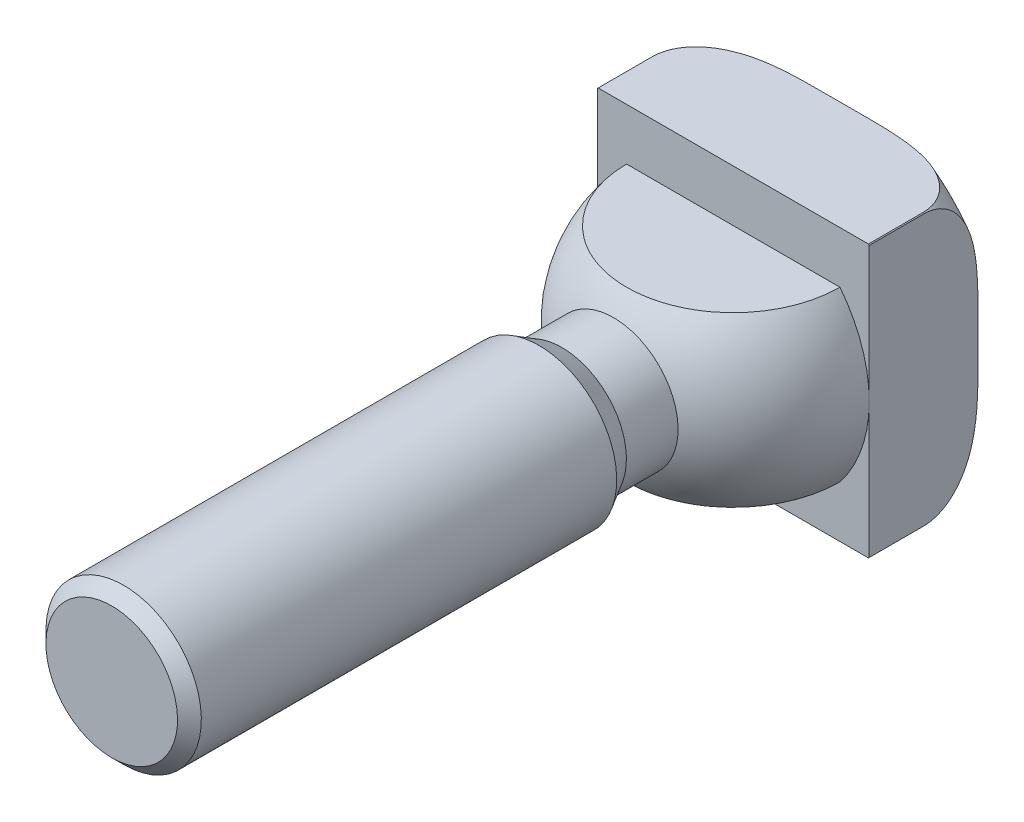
ISO-10303-21;
HEADER;
FILE_DESCRIPTION(('STEP AP214'),'2;1');
FILE_NAME('part.step','',(''),(''),'','','');
FILE_SCHEMA(('AUTOMOTIVE_DESIGN { 1 0 10303 214 1 1 1 1 }'));
ENDSEC;
DATA;
#1=APPLICATION_CONTEXT('core data for automotive mechanical design processes');
#2=APPLICATION_PROTOCOL_DEFINITION('international standard','automotive_design',2000,#1);
#3=PRODUCT_CONTEXT('',#1,'mechanical');
#4=PRODUCT('Part','Part','',(#3));
#5=PRODUCT_RELATED_PRODUCT_CATEGORY('part','',(#4));
#6=PRODUCT_DEFINITION_FORMATION('','',#4);
#7=PRODUCT_DEFINITION_CONTEXT('part definition',#1,'design');
#8=PRODUCT_DEFINITION('design','',#6,#7);
#9=PRODUCT_DEFINITION_SHAPE('','',#8);
#10=(LENGTH_UNIT() NAMED_UNIT(*) SI_UNIT(.MILLI.,.METRE.));
#11=(NAMED_UNIT(*) PLANE_ANGLE_UNIT() SI_UNIT($,.RADIAN.));
#12=(NAMED_UNIT(*) SI_UNIT($,.STERADIAN.) SOLID_ANGLE_UNIT());
#13=UNCERTAINTY_MEASURE_WITH_UNIT(LENGTH_MEASURE(1.E-05),#10,'distance_accuracy_value','');
#14=(GEOMETRIC_REPRESENTATION_CONTEXT(3) GLOBAL_UNCERTAINTY_ASSIGNED_CONTEXT((#13)) GLOBAL_UNIT_ASSIGNED_CONTEXT((#10,
#11,#12)) REPRESENTATION_CONTEXT('',''));
#15=CARTESIAN_POINT('',(0.,0.,0.));
#16=DIRECTION('',(0.,0.,1.));
#17=DIRECTION('',(1.,0.,0.));
#18=AXIS2_PLACEMENT_3D('',#15,#16,#17);
#19=CARTESIAN_POINT('',(0.,0.,-7.));
#20=DIRECTION('',(0.,0.,1.));
#21=DIRECTION('',(0.,1.,0.));
#22=AXIS2_PLACEMENT_3D('',#19,#20,#21);
#23=TOROIDAL_SURFACE('',#22,17.675,7.);
#24=CARTESIAN_POINT('',(-17.5,0.,-13.9978121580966));
#25=CARTESIAN_POINT('',(-17.5,-0.388449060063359,-13.9978135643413));
#26=CARTESIAN_POINT('',(-17.5,-0.776898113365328,-13.9981723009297));
#27=CARTESIAN_POINT('',(-17.5,-1.55379576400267,-13.9991757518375));
#28=CARTESIAN_POINT('',(-17.5,-1.94224436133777,-13.9998204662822));
#29=CARTESIAN_POINT('',(-17.5,-2.71944594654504,-14.0001197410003));
#30=CARTESIAN_POINT('',(-17.5,-3.10819893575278,-13.9997735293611));
#31=CARTESIAN_POINT('',(-17.5,-3.88570470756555,-13.9960499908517));
#32=CARTESIAN_POINT('',(-17.5,-4.27445748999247,-13.9926725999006));
#33=CARTESIAN_POINT('',(-17.5,-5.05178059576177,-13.9801914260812));
#34=CARTESIAN_POINT('',(-17.5,-5.44035094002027,-13.9710891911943));
#35=CARTESIAN_POINT('',(-17.5,-6.21718955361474,-13.9439137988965));
#36=CARTESIAN_POINT('',(-17.5,-6.60545783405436,-13.925840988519));
#37=CARTESIAN_POINT('',(-17.5,-7.38071641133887,-13.8770435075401));
#38=CARTESIAN_POINT('',(-17.5,-7.76770772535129,-13.8463359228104));
#39=CARTESIAN_POINT('',(-17.5,-8.54012803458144,-13.7681554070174));
#40=CARTESIAN_POINT('',(-17.5,-8.92555672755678,-13.7206793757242));
#41=CARTESIAN_POINT('',(-17.5,-9.7004715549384,-13.60339673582));
#42=CARTESIAN_POINT('',(-17.5,-10.0898988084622,-13.5331891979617));
#43=CARTESIAN_POINT('',(-17.5,-10.862789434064,-13.3656834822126));
#44=CARTESIAN_POINT('',(-17.5,-11.2462560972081,-13.2684008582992));
#45=CARTESIAN_POINT('',(-17.5,-12.0018639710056,-13.0419072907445));
#46=CARTESIAN_POINT('',(-17.5,-12.3740499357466,-12.9128485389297));
#47=CARTESIAN_POINT('',(-17.5,-13.1030630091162,-12.6173528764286));
#48=CARTESIAN_POINT('',(-17.5,-13.4599078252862,-12.4509605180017));
#49=CARTESIAN_POINT('',(-17.5,-14.1420716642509,-12.0805223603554));
#50=CARTESIAN_POINT('',(-17.5,-14.4679611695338,-11.8775401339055));
#51=CARTESIAN_POINT('',(-17.5,-15.0887495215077,-11.4272204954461));
#52=CARTESIAN_POINT('',(-17.5,-15.3836232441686,-11.1798475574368));
#53=CARTESIAN_POINT('',(-17.5,-15.7939764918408,-10.7735991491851));
#54=CARTESIAN_POINT('',(-17.5,-15.9261224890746,-10.631366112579));
#55=CARTESIAN_POINT('',(-17.5,-16.1771074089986,-10.3356481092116));
#56=CARTESIAN_POINT('',(-17.5,-16.2959534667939,-10.182169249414));
#57=CARTESIAN_POINT('',(-17.5,-16.5182174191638,-9.86471839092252));
#58=CARTESIAN_POINT('',(-17.5,-16.621657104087,-9.7007616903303));
#59=CARTESIAN_POINT('',(-17.5,-16.8112745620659,-9.36316201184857));
#60=CARTESIAN_POINT('',(-17.5,-16.8974588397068,-9.18952271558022));
#61=CARTESIAN_POINT('',(-17.5,-17.0306833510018,-8.88040626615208));
#62=CARTESIAN_POINT('',(-17.5,-17.0820701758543,-8.74678868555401));
#63=CARTESIAN_POINT('',(-17.5,-17.1737078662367,-8.47579588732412));
#64=CARTESIAN_POINT('',(-17.5,-17.2139608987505,-8.33842140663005));
#65=CARTESIAN_POINT('',(-17.5,-17.2827502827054,-8.06081624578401));
#66=CARTESIAN_POINT('',(-17.5,-17.3112907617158,-7.92058659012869));
#67=CARTESIAN_POINT('',(-17.5,-17.3562505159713,-7.63818623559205));
#68=CARTESIAN_POINT('',(-17.5,-17.3726693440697,-7.49601546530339));
#69=CARTESIAN_POINT('',(-17.5,-17.3931454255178,-7.2105534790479));
#70=CARTESIAN_POINT('',(-17.5,-17.397182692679,-7.06726082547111));
#71=CARTESIAN_POINT('',(-17.5,-17.3927747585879,-6.7808164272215));
#72=CARTESIAN_POINT('',(-17.5,-17.384325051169,-6.63766475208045));
#73=CARTESIAN_POINT('',(-17.5,-17.3550717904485,-6.35267251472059));
#74=CARTESIAN_POINT('',(-17.5,-17.3342716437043,-6.21083160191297));
#75=CARTESIAN_POINT('',(-17.5,-17.2806315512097,-5.92939609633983));
#76=CARTESIAN_POINT('',(-17.5,-17.2477870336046,-5.7898023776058));
#77=CARTESIAN_POINT('',(-17.5,-17.1714713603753,-5.51717596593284));
#78=CARTESIAN_POINT('',(-17.5,-17.1282750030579,-5.38406622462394));
#79=CARTESIAN_POINT('',(-17.5,-17.031454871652,-5.12167690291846));
#80=CARTESIAN_POINT('',(-17.5,-16.9778274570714,-4.99239867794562));
#81=CARTESIAN_POINT('',(-17.5,-16.8023047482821,-4.61143348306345));
#82=CARTESIAN_POINT('',(-17.5,-16.6657030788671,-4.36638565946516));
#83=CARTESIAN_POINT('',(-17.5,-16.3450249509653,-3.87627597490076));
#84=CARTESIAN_POINT('',(-17.5,-16.1576961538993,-3.63337111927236));
#85=CARTESIAN_POINT('',(-17.5,-15.7511437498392,-3.17579814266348));
#86=CARTESIAN_POINT('',(-17.5,-15.5318923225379,-2.96115496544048));
#87=CARTESIAN_POINT('',(-17.5,-15.1166648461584,-2.60199856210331));
#88=CARTESIAN_POINT('',(-17.5,-14.925227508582,-2.45215518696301));
#89=CARTESIAN_POINT('',(-17.5,-14.5298270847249,-2.16994195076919));
#90=CARTESIAN_POINT('',(-17.5,-14.3258580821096,-2.03758043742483));
#91=CARTESIAN_POINT('',(-17.5,-13.6988818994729,-1.6653897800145));
#92=CARTESIAN_POINT('',(-17.5,-13.2609105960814,-1.45054196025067));
#93=CARTESIAN_POINT('',(-17.5,-12.4409472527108,-1.11157031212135));
#94=CARTESIAN_POINT('',(-17.5,-12.0626184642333,-0.97814210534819));
#95=CARTESIAN_POINT('',(-17.5,-11.2955303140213,-0.744772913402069));
#96=CARTESIAN_POINT('',(-17.5,-10.9067630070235,-0.644858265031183));
#97=CARTESIAN_POINT('',(-17.5,-10.121671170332,-0.47277573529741));
#98=CARTESIAN_POINT('',(-17.5,-9.72532251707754,-0.400721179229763));
#99=CARTESIAN_POINT('',(-17.5,-8.92940755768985,-0.27956258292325));
#100=CARTESIAN_POINT('',(-17.5,-8.52984271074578,-0.230448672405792));
#101=CARTESIAN_POINT('',(-17.5,-7.60752790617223,-0.137940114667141));
#102=CARTESIAN_POINT('',(-17.5,-7.08417339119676,-0.100798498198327));
#103=CARTESIAN_POINT('',(-17.5,-6.03635725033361,-0.0469308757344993));
#104=CARTESIAN_POINT('',(-17.5,-5.51189527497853,-0.0302127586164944));
#105=CARTESIAN_POINT('',(-17.5,-4.72472261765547,-0.0140997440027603));
#106=CARTESIAN_POINT('',(-17.5,-4.46208166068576,-0.010223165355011));
#107=CARTESIAN_POINT('',(-17.5,-3.93677626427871,-0.00457927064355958));
#108=CARTESIAN_POINT('',(-17.5,-3.67411182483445,-0.00281195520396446));
#109=CARTESIAN_POINT('',(-17.5,-3.14882284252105,-0.000594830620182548));
#110=CARTESIAN_POINT('',(-17.5,-2.88619830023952,-0.000144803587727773));
#111=CARTESIAN_POINT('',(-17.5,-2.36094969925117,8.43665232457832E-05));
#112=CARTESIAN_POINT('',(-17.5,-2.09832564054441,-0.000136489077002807));
#113=CARTESIAN_POINT('',(-17.5,-1.57325334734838,-0.000754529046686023));
#114=CARTESIAN_POINT('',(-17.5,-1.3108051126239,-0.00115159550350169));
#115=CARTESIAN_POINT('',(-17.5,-0.785908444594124,-0.00179565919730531));
#116=CARTESIAN_POINT('',(-17.5,-0.523460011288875,-0.00204265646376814));
#117=CARTESIAN_POINT('',(-17.5,0.00144887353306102,-0.00223622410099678));
#118=CARTESIAN_POINT('',(-17.5,0.263909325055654,-0.00218278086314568));
#119=CARTESIAN_POINT('',(-17.5,0.788829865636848,-0.00180601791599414));
#120=CARTESIAN_POINT('',(-17.5,1.05128995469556,-0.00148269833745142));
#121=CARTESIAN_POINT('',(-17.5,1.57605180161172,-0.000776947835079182));
#122=CARTESIAN_POINT('',(-17.5,1.83835355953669,-0.000394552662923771));
#123=CARTESIAN_POINT('',(-17.5,2.36295729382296,4.63168922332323E-05));
#124=CARTESIAN_POINT('',(-17.5,2.62525927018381,0.00010479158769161));
#125=CARTESIAN_POINT('',(-17.5,3.149853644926,-0.000647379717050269));
#126=CARTESIAN_POINT('',(-17.5,3.4121460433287,-0.00145799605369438));
#127=CARTESIAN_POINT('',(-17.5,3.93672069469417,-0.00464072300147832));
#128=CARTESIAN_POINT('',(-17.5,4.1990029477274,-0.00701281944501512));
#129=CARTESIAN_POINT('',(-17.5,4.65230158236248,-0.013176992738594));
#130=CARTESIAN_POINT('',(-17.5,4.84332513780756,-0.0164083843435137));
#131=CARTESIAN_POINT('',(-17.5,5.22533824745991,-0.0245003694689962));
#132=CARTESIAN_POINT('',(-17.5,5.41632780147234,-0.0293609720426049));
#133=CARTESIAN_POINT('',(-17.5,5.98924358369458,-0.0469622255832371));
#134=CARTESIAN_POINT('',(-17.5,6.37108844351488,-0.0627220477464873));
#135=CARTESIAN_POINT('',(-17.5,7.13466290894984,-0.105754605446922));
#136=CARTESIAN_POINT('',(-17.5,7.51639171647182,-0.133042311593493));
#137=CARTESIAN_POINT('',(-17.5,8.27847662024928,-0.202989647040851));
#138=CARTESIAN_POINT('',(-17.5,8.65883277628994,-0.245648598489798));
#139=CARTESIAN_POINT('',(-17.5,9.42195850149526,-0.351246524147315));
#140=CARTESIAN_POINT('',(-17.5,9.80469288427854,-0.414447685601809));
#141=CARTESIAN_POINT('',(-17.5,10.5654459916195,-0.565698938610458));
#142=CARTESIAN_POINT('',(-17.5,10.943463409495,-0.653755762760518));
#143=CARTESIAN_POINT('',(-17.5,11.6902728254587,-0.859393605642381));
#144=CARTESIAN_POINT('',(-17.5,12.0590899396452,-0.97688159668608));
#145=CARTESIAN_POINT('',(-17.5,12.7836720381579,-1.24650276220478));
#146=CARTESIAN_POINT('',(-17.5,13.1394491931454,-1.39860262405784));
#147=CARTESIAN_POINT('',(-17.5,13.8415571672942,-1.74733174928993));
#148=CARTESIAN_POINT('',(-17.5,14.1873239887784,-1.94511352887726));
#149=CARTESIAN_POINT('',(-17.5,14.8485763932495,-2.38739698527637));
#150=CARTESIAN_POINT('',(-17.5,15.1640528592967,-2.63191266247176));
#151=CARTESIAN_POINT('',(-17.5,15.6057116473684,-3.03656741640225));
#152=CARTESIAN_POINT('',(-17.5,15.7484799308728,-3.17879792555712));
#153=CARTESIAN_POINT('',(-17.5,16.02058218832,-3.47553091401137));
#154=CARTESIAN_POINT('',(-17.5,16.1499236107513,-3.6300265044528));
#155=CARTESIAN_POINT('',(-17.5,16.392848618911,-3.95063608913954));
#156=CARTESIAN_POINT('',(-17.5,16.5064542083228,-4.11673336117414));
#157=CARTESIAN_POINT('',(-17.5,16.7158362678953,-4.45979707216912));
#158=CARTESIAN_POINT('',(-17.5,16.8116204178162,-4.63675878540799));
#159=CARTESIAN_POINT('',(-17.5,16.9589551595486,-4.94876888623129));
#160=CARTESIAN_POINT('',(-17.5,17.0153588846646,-5.08154294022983));
#161=CARTESIAN_POINT('',(-17.5,17.117142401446,-5.35124238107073));
#162=CARTESIAN_POINT('',(-17.5,17.1625245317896,-5.48816688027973));
#163=CARTESIAN_POINT('',(-17.5,17.2416148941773,-5.76529141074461));
#164=CARTESIAN_POINT('',(-17.5,17.2753279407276,-5.90549006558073));
#165=CARTESIAN_POINT('',(-17.5,17.3306061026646,-6.18827496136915));
#166=CARTESIAN_POINT('',(-17.5,17.3521707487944,-6.3308612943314));
#167=CARTESIAN_POINT('',(-17.5,17.3828473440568,-6.61768637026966));
#168=CARTESIAN_POINT('',(-17.5,17.3919319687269,-6.76192804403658));
#169=CARTESIAN_POINT('',(-17.5,17.3974162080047,-7.05070537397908));
#170=CARTESIAN_POINT('',(-17.5,17.3938112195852,-7.1952411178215));
#171=CARTESIAN_POINT('',(-17.5,17.3739668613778,-7.48339401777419));
#172=CARTESIAN_POINT('',(-17.5,17.3577315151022,-7.62701145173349));
#173=CARTESIAN_POINT('',(-17.5,17.3128806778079,-7.9123497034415));
#174=CARTESIAN_POINT('',(-17.5,17.2842605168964,-8.05406978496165));
#175=CARTESIAN_POINT('',(-17.5,17.216265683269,-8.32972580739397));
#176=CARTESIAN_POINT('',(-17.5,17.1772954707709,-8.46376171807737));
#177=CARTESIAN_POINT('',(-17.5,17.0887514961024,-8.72830148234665));
#178=CARTESIAN_POINT('',(-17.5,17.0391740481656,-8.85880409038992));
#179=CARTESIAN_POINT('',(-17.5,16.8754700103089,-9.2438384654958));
#180=CARTESIAN_POINT('',(-17.5,16.7463149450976,-9.49212171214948));
#181=CARTESIAN_POINT('',(-17.5,16.4418120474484,-9.98701450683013));
#182=CARTESIAN_POINT('',(-17.5,16.2635309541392,-10.2317936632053));
#183=CARTESIAN_POINT('',(-17.5,15.8745026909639,-10.6940423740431));
#184=CARTESIAN_POINT('',(-17.5,15.6637350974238,-10.911494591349));
#185=CARTESIAN_POINT('',(-17.5,15.2660576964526,-11.2735884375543));
#186=CARTESIAN_POINT('',(-17.5,15.0840775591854,-11.4237312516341));
#187=CARTESIAN_POINT('',(-17.5,14.7075403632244,-11.7073892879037));
#188=CARTESIAN_POINT('',(-17.5,14.5129776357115,-11.8408969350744));
#189=CARTESIAN_POINT('',(-17.5,13.9137092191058,-12.2177425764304));
#190=CARTESIAN_POINT('',(-17.5,13.4937742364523,-12.4370952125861));
#191=CARTESIAN_POINT('',(-17.5,12.7133171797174,-12.7823631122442));
#192=CARTESIAN_POINT('',(-17.5,12.3569593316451,-12.9181401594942));
#193=CARTESIAN_POINT('',(-17.5,11.6335174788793,-13.1580292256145));
#194=CARTESIAN_POINT('',(-17.5,11.2664258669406,-13.2621181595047));
#195=CARTESIAN_POINT('',(-17.5,10.5251422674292,-13.443446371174));
#196=CARTESIAN_POINT('',(-17.5,10.1509388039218,-13.5206375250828));
#197=CARTESIAN_POINT('',(-17.5,9.39854189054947,-13.6526484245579));
#198=CARTESIAN_POINT('',(-17.5,9.0203469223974,-13.7074593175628));
#199=CARTESIAN_POINT('',(-17.5,8.28352844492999,-13.7964449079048));
#200=CARTESIAN_POINT('',(-17.5,7.92502154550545,-13.8316198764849));
#201=CARTESIAN_POINT('',(-17.5,7.20708250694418,-13.8893676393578));
#202=CARTESIAN_POINT('',(-17.5,6.84765051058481,-13.911942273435));
#203=CARTESIAN_POINT('',(-17.5,6.12802310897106,-13.9476437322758));
#204=CARTESIAN_POINT('',(-17.5,5.76782730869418,-13.9607621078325));
#205=CARTESIAN_POINT('',(-17.5,5.04725920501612,-13.9803383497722));
#206=CARTESIAN_POINT('',(-17.5,4.68688689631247,-13.9867960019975));
#207=CARTESIAN_POINT('',(-17.5,3.96586036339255,-13.9955068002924));
#208=CARTESIAN_POINT('',(-17.5,3.60520611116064,-13.9977571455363));
#209=CARTESIAN_POINT('',(-17.5,2.88389986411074,-14.0000731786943));
#210=CARTESIAN_POINT('',(-17.5,2.52324786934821,-14.0001389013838));
#211=CARTESIAN_POINT('',(-17.5,1.8021635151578,-13.9996106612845));
#212=CARTESIAN_POINT('',(-17.5,1.44173115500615,-13.9990170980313));
#213=CARTESIAN_POINT('',(-17.5,0.720865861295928,-13.9981171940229));
#214=CARTESIAN_POINT('',(-17.5,0.360432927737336,-13.9978108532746));
#215=CARTESIAN_POINT('',(-17.5,0.,-13.9978121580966));
#216=B_SPLINE_CURVE_WITH_KNOTS('',3,(#24,#25,#26,#27,#28,#29,#30,#31,#32,#33,#34,#35,#36,#37,
#38,#39,#40,#41,#42,#43,#44,#45,#46,#47,#48,#49,#50,#51,#52,#53,#54,#55,#56,#57,#58,#59,#60,#61,
#62,#63,#64,#65,#66,#67,#68,#69,#70,#71,#72,#73,#74,#75,#76,#77,#78,#79,#80,#81,#82,#83,#84,#85,
#86,#87,#88,#89,#90,#91,#92,#93,#94,#95,#96,#97,#98,#99,#100,#101,#102,#103,#104,#105,#106,#107,
#108,#109,#110,#111,#112,#113,#114,#115,#116,#117,#118,#119,#120,#121,#122,#123,#124,#125,#126,
#127,#128,#129,#130,#131,#132,#133,#134,#135,#136,#137,#138,#139,#140,#141,#142,#143,#144,#145,
#146,#147,#148,#149,#150,#151,#152,#153,#154,#155,#156,#157,#158,#159,#160,#161,#162,#163,#164,
#165,#166,#167,#168,#169,#170,#171,#172,#173,#174,#175,#176,#177,#178,#179,#180,#181,#182,#183,
#184,#185,#186,#187,#188,#189,#190,#191,#192,#193,#194,#195,#196,#197,#198,#199,#200,#201,#202,
#203,#204,#205,#206,#207,#208,#209,#210,#211,#212,#213,#214,#215),.UNSPECIFIED.,.T.,.F.,(4,2,2,
2,2,2,2,2,2,2,2,2,2,2,2,2,2,2,2,2,2,2,2,2,2,2,2,2,2,2,2,2,2,2,2,2,2,2,2,2,2,2,2,2,2,2,2,2,2,2,2,
2,2,2,2,2,2,2,2,2,2,2,2,2,2,2,2,2,2,2,2,2,2,2,2,2,2,2,2,2,2,2,2,2,2,2,2,2,2,2,2,2,2,2,2,4),(0.,
1.16534717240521,2.33069485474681,3.49695056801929,4.66323093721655,5.82919608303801,
6.99511612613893,8.15946466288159,9.32402858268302,10.5103669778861,11.6960252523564,
12.8761116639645,14.0547972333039,15.2035486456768,16.353223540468,16.9350159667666,
17.5164947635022,18.09714315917,18.6775722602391,19.1066044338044,19.5355530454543,
19.9643503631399,20.3931634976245,20.8226684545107,21.2523284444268,21.6818699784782,
22.1115747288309,22.5309369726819,22.9504458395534,23.7887527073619,24.7057344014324,
25.6235200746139,26.3518416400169,27.0805097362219,28.5382509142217,29.7401885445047,
30.943068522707,32.150791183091,33.3579937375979,34.9313525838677,36.5053189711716,
37.2933227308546,38.0813267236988,38.8692003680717,39.6570724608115,40.4444181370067,
41.2317636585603,42.019144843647,42.8065256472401,43.5934317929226,44.3803371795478,
45.1672157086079,45.9540870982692,46.5272334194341,47.1003829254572,48.2467673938,
49.3946452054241,50.5424724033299,51.7055662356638,52.8689754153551,54.028752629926,
55.1874182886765,56.3793313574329,57.5716020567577,58.1754983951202,58.7790579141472,
59.3817647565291,59.9842112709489,60.4165476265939,60.8487921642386,61.280858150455,
61.7129408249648,62.1459680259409,62.5791523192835,63.0121986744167,63.4454084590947,
63.8636941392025,64.282125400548,65.1182997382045,66.0235061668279,66.9292840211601,
67.6360904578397,68.3432175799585,69.7588553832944,70.9014301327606,72.0448352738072,
73.1902757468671,74.3361688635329,75.4165796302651,76.4968326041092,77.5780495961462,
78.6593013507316,79.741272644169,80.8232267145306,81.9045254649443,82.9858242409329),.UNSPECIFIED.);
#217=CARTESIAN_POINT('',(-17.5,-2.48105320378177,-14.));
#218=VERTEX_POINT('',#217);
#219=CARTESIAN_POINT('',(-17.5,-17.3955633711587,-7.));
#220=VERTEX_POINT('',#219);
#221=EDGE_CURVE('E140',#218,#220,#216,.T.);
#222=ORIENTED_EDGE('',*,*,#221,.F.);
#223=CARTESIAN_POINT('',(0.,0.,-14.));
#224=DIRECTION('',(0.,0.,1.));
#225=DIRECTION('',(0.,1.,0.));
#226=AXIS2_PLACEMENT_3D('',#223,#224,#225);
#227=CIRCLE('',#226,17.675);
#228=CARTESIAN_POINT('',(-2.48105320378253,-17.5,-14.));
#229=VERTEX_POINT('',#228);
#230=EDGE_CURVE('E239',#218,#229,#227,.T.);
#231=ORIENTED_EDGE('',*,*,#230,.T.);
#232=CARTESIAN_POINT('',(0.,-17.5,-13.9978121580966));
#233=CARTESIAN_POINT('',(0.388449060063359,-17.5,-13.9978135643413));
#234=CARTESIAN_POINT('',(0.776898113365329,-17.5,-13.9981723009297));
#235=CARTESIAN_POINT('',(1.55379576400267,-17.5,-13.9991757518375));
#236=CARTESIAN_POINT('',(1.94224436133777,-17.5,-13.9998204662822));
#237=CARTESIAN_POINT('',(2.71944594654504,-17.5,-14.0001197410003));
#238=CARTESIAN_POINT('',(3.10819893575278,-17.5,-13.9997735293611));
#239=CARTESIAN_POINT('',(3.88570470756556,-17.5,-13.9960499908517));
#240=CARTESIAN_POINT('',(4.27445748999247,-17.5,-13.9926725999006));
#241=CARTESIAN_POINT('',(5.05178059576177,-17.5,-13.9801914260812));
#242=CARTESIAN_POINT('',(5.44035094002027,-17.5,-13.9710891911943));
#243=CARTESIAN_POINT('',(6.21718955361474,-17.5,-13.9439137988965));
#244=CARTESIAN_POINT('',(6.60545783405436,-17.5,-13.925840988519));
#245=CARTESIAN_POINT('',(7.38071641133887,-17.5,-13.8770435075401));
#246=CARTESIAN_POINT('',(7.76770772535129,-17.5,-13.8463359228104));
#247=CARTESIAN_POINT('',(8.54012803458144,-17.5,-13.7681554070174));
#248=CARTESIAN_POINT('',(8.92555672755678,-17.5,-13.7206793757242));
#249=CARTESIAN_POINT('',(9.70047155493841,-17.5,-13.60339673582));
#250=CARTESIAN_POINT('',(10.0898988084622,-17.5,-13.5331891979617));
#251=CARTESIAN_POINT('',(10.862789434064,-17.5,-13.3656834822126));
#252=CARTESIAN_POINT('',(11.2462560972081,-17.5,-13.2684008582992));
#253=CARTESIAN_POINT('',(12.0018639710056,-17.5,-13.0419072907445));
#254=CARTESIAN_POINT('',(12.3740499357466,-17.5,-12.9128485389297));
#255=CARTESIAN_POINT('',(13.1030630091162,-17.5,-12.6173528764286));
#256=CARTESIAN_POINT('',(13.4599078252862,-17.5,-12.4509605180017));
#257=CARTESIAN_POINT('',(14.1420716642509,-17.5,-12.0805223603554));
#258=CARTESIAN_POINT('',(14.4679611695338,-17.5,-11.8775401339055));
#259=CARTESIAN_POINT('',(15.0887495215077,-17.5,-11.4272204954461));
#260=CARTESIAN_POINT('',(15.3836232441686,-17.5,-11.1798475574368));
#261=CARTESIAN_POINT('',(15.7939764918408,-17.5,-10.7735991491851));
#262=CARTESIAN_POINT('',(15.9261224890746,-17.5,-10.631366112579));
#263=CARTESIAN_POINT('',(16.1771074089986,-17.5,-10.3356481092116));
#264=CARTESIAN_POINT('',(16.2959534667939,-17.5,-10.182169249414));
#265=CARTESIAN_POINT('',(16.5182174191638,-17.5,-9.86471839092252));
#266=CARTESIAN_POINT('',(16.621657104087,-17.5,-9.7007616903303));
#267=CARTESIAN_POINT('',(16.8112745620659,-17.5,-9.36316201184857));
#268=CARTESIAN_POINT('',(16.8974588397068,-17.5,-9.18952271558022));
#269=CARTESIAN_POINT('',(17.0306833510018,-17.5,-8.88040626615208));
#270=CARTESIAN_POINT('',(17.0820701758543,-17.5,-8.74678868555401));
#271=CARTESIAN_POINT('',(17.1737078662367,-17.5,-8.47579588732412));
#272=CARTESIAN_POINT('',(17.2139608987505,-17.5,-8.33842140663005));
#273=CARTESIAN_POINT('',(17.2827502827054,-17.5,-8.06081624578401));
#274=CARTESIAN_POINT('',(17.3112907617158,-17.5,-7.92058659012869));
#275=CARTESIAN_POINT('',(17.3562505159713,-17.5,-7.63818623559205));
#276=CARTESIAN_POINT('',(17.3726693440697,-17.5,-7.4960154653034));
#277=CARTESIAN_POINT('',(17.3931454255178,-17.5,-7.2105534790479));
#278=CARTESIAN_POINT('',(17.397182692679,-17.5,-7.06726082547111));
#279=CARTESIAN_POINT('',(17.3927747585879,-17.5,-6.78081642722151));
#280=CARTESIAN_POINT('',(17.384325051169,-17.5,-6.63766475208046));
#281=CARTESIAN_POINT('',(17.3550717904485,-17.5,-6.35267251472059));
#282=CARTESIAN_POINT('',(17.3342716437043,-17.5,-6.21083160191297));
#283=CARTESIAN_POINT('',(17.2806315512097,-17.5,-5.92939609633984));
#284=CARTESIAN_POINT('',(17.2477870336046,-17.5,-5.78980237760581));
#285=CARTESIAN_POINT('',(17.1714713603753,-17.5,-5.51717596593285));
#286=CARTESIAN_POINT('',(17.1282750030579,-17.5,-5.38406622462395));
#287=CARTESIAN_POINT('',(17.031454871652,-17.5,-5.12167690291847));
#288=CARTESIAN_POINT('',(16.9778274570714,-17.5,-4.99239867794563));
#289=CARTESIAN_POINT('',(16.8023047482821,-17.5,-4.61143348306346));
#290=CARTESIAN_POINT('',(16.6657030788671,-17.5,-4.36638565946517));
#291=CARTESIAN_POINT('',(16.3450249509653,-17.5,-3.87627597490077));
#292=CARTESIAN_POINT('',(16.1576961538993,-17.5,-3.63337111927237));
#293=CARTESIAN_POINT('',(15.7511437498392,-17.5,-3.17579814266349));
#294=CARTESIAN_POINT('',(15.5318923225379,-17.5,-2.96115496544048));
#295=CARTESIAN_POINT('',(15.1166648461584,-17.5,-2.60199856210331));
#296=CARTESIAN_POINT('',(14.925227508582,-17.5,-2.45215518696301));
#297=CARTESIAN_POINT('',(14.5298270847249,-17.5,-2.1699419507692));
#298=CARTESIAN_POINT('',(14.3258580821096,-17.5,-2.03758043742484));
#299=CARTESIAN_POINT('',(13.6988818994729,-17.5,-1.66538978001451));
#300=CARTESIAN_POINT('',(13.2609105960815,-17.5,-1.45054196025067));
#301=CARTESIAN_POINT('',(12.4409472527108,-17.5,-1.11157031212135));
#302=CARTESIAN_POINT('',(12.0626184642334,-17.5,-0.978142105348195));
#303=CARTESIAN_POINT('',(11.2955303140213,-17.5,-0.744772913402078));
#304=CARTESIAN_POINT('',(10.9067630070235,-17.5,-0.64485826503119));
#305=CARTESIAN_POINT('',(10.121671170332,-17.5,-0.472775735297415));
#306=CARTESIAN_POINT('',(9.72532251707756,-17.5,-0.400721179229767));
#307=CARTESIAN_POINT('',(8.92940755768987,-17.5,-0.279562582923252));
#308=CARTESIAN_POINT('',(8.5298427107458,-17.5,-0.230448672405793));
#309=CARTESIAN_POINT('',(7.60752790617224,-17.5,-0.13794011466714));
#310=CARTESIAN_POINT('',(7.08417339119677,-17.5,-0.100798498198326));
#311=CARTESIAN_POINT('',(6.03635725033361,-17.5,-0.0469308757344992));
#312=CARTESIAN_POINT('',(5.51189527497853,-17.5,-0.0302127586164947));
#313=CARTESIAN_POINT('',(4.72472261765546,-17.5,-0.0140997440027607));
#314=CARTESIAN_POINT('',(4.46208166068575,-17.5,-0.0102231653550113));
#315=CARTESIAN_POINT('',(3.9367762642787,-17.5,-0.00457927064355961));
#316=CARTESIAN_POINT('',(3.67411182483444,-17.5,-0.00281195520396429));
#317=CARTESIAN_POINT('',(3.14882284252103,-17.5,-0.000594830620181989));
#318=CARTESIAN_POINT('',(2.88619830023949,-17.5,-0.000144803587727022));
#319=CARTESIAN_POINT('',(2.36094969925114,-17.5,8.43665232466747E-05));
#320=CARTESIAN_POINT('',(2.09832564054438,-17.5,-0.000136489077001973));
#321=CARTESIAN_POINT('',(1.57325334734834,-17.5,-0.000754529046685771));
#322=CARTESIAN_POINT('',(1.31080511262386,-17.5,-0.00115159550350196));
#323=CARTESIAN_POINT('',(0.785908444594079,-17.5,-0.00179565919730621));
#324=CARTESIAN_POINT('',(0.52346001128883,-17.5,-0.00204265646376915));
#325=CARTESIAN_POINT('',(-0.00144887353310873,-17.5,-0.002236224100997));
#326=CARTESIAN_POINT('',(-0.263909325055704,-17.5,-0.00218278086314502));
#327=CARTESIAN_POINT('',(-0.788829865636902,-17.5,-0.00180601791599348));
#328=CARTESIAN_POINT('',(-1.05128995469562,-17.5,-0.00148269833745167));
#329=CARTESIAN_POINT('',(-1.57605180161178,-17.5,-0.000776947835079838));
#330=CARTESIAN_POINT('',(-1.83835355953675,-17.5,-0.000394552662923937));
#331=CARTESIAN_POINT('',(-2.36295729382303,-17.5,4.63168922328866E-05));
#332=CARTESIAN_POINT('',(-2.62525927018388,-17.5,0.000104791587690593));
#333=CARTESIAN_POINT('',(-3.14985364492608,-17.5,-0.000647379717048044));
#334=CARTESIAN_POINT('',(-3.41214604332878,-17.5,-0.00145799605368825));
#335=CARTESIAN_POINT('',(-3.93672069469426,-17.5,-0.00464072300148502));
#336=CARTESIAN_POINT('',(-4.19900294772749,-17.5,-0.00701281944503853));
#337=CARTESIAN_POINT('',(-4.65230158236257,-17.5,-0.0131769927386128));
#338=CARTESIAN_POINT('',(-4.84332513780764,-17.5,-0.0164083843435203));
#339=CARTESIAN_POINT('',(-5.22533824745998,-17.5,-0.0245003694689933));
#340=CARTESIAN_POINT('',(-5.41632780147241,-17.5,-0.0293609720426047));
#341=CARTESIAN_POINT('',(-5.98924358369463,-17.5,-0.0469622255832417));
#342=CARTESIAN_POINT('',(-6.37108844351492,-17.5,-0.0627220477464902));
#343=CARTESIAN_POINT('',(-7.13466290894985,-17.5,-0.105754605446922));
#344=CARTESIAN_POINT('',(-7.51639171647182,-17.5,-0.133042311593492));
#345=CARTESIAN_POINT('',(-8.27847662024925,-17.5,-0.20298964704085));
#346=CARTESIAN_POINT('',(-8.65883277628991,-17.5,-0.2456485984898));
#347=CARTESIAN_POINT('',(-9.4219585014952,-17.5,-0.351246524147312));
#348=CARTESIAN_POINT('',(-9.80469288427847,-17.5,-0.414447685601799));
#349=CARTESIAN_POINT('',(-10.5654459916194,-17.5,-0.565698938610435));
#350=CARTESIAN_POINT('',(-10.9434634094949,-17.5,-0.653755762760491));
#351=CARTESIAN_POINT('',(-11.6902728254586,-17.5,-0.859393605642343));
#352=CARTESIAN_POINT('',(-12.059089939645,-17.5,-0.976881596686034));
#353=CARTESIAN_POINT('',(-12.7836720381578,-17.5,-1.24650276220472));
#354=CARTESIAN_POINT('',(-13.1394491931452,-17.5,-1.39860262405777));
#355=CARTESIAN_POINT('',(-13.8415571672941,-17.5,-1.74733174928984));
#356=CARTESIAN_POINT('',(-14.1873239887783,-17.5,-1.94511352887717));
#357=CARTESIAN_POINT('',(-14.8485763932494,-17.5,-2.38739698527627));
#358=CARTESIAN_POINT('',(-15.1640528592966,-17.5,-2.63191266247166));
#359=CARTESIAN_POINT('',(-15.6057116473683,-17.5,-3.03656741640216));
#360=CARTESIAN_POINT('',(-15.7484799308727,-17.5,-3.17879792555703));
#361=CARTESIAN_POINT('',(-16.0205821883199,-17.5,-3.47553091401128));
#362=CARTESIAN_POINT('',(-16.1499236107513,-17.5,-3.63002650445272));
#363=CARTESIAN_POINT('',(-16.392848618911,-17.5,-3.95063608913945));
#364=CARTESIAN_POINT('',(-16.5064542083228,-17.5,-4.11673336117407));
#365=CARTESIAN_POINT('',(-16.7158362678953,-17.5,-4.45979707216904));
#366=CARTESIAN_POINT('',(-16.8116204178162,-17.5,-4.6367587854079));
#367=CARTESIAN_POINT('',(-16.9589551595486,-17.5,-4.9487688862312));
#368=CARTESIAN_POINT('',(-17.0153588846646,-17.5,-5.08154294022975));
#369=CARTESIAN_POINT('',(-17.117142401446,-17.5,-5.35124238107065));
#370=CARTESIAN_POINT('',(-17.1625245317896,-17.5,-5.48816688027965));
#371=CARTESIAN_POINT('',(-17.2416148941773,-17.5,-5.76529141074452));
#372=CARTESIAN_POINT('',(-17.2753279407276,-17.5,-5.90549006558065));
#373=CARTESIAN_POINT('',(-17.3306061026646,-17.5,-6.18827496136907));
#374=CARTESIAN_POINT('',(-17.3521707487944,-17.5,-6.33086129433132));
#375=CARTESIAN_POINT('',(-17.3828473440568,-17.5,-6.61768637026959));
#376=CARTESIAN_POINT('',(-17.3919319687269,-17.5,-6.76192804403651));
#377=CARTESIAN_POINT('',(-17.3974162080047,-17.5,-7.050705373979));
#378=CARTESIAN_POINT('',(-17.3938112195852,-17.5,-7.19524111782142));
#379=CARTESIAN_POINT('',(-17.3739668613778,-17.5,-7.48339401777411));
#380=CARTESIAN_POINT('',(-17.3577315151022,-17.5,-7.62701145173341));
#381=CARTESIAN_POINT('',(-17.3128806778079,-17.5,-7.91234970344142));
#382=CARTESIAN_POINT('',(-17.2842605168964,-17.5,-8.05406978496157));
#383=CARTESIAN_POINT('',(-17.2162656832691,-17.5,-8.32972580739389));
#384=CARTESIAN_POINT('',(-17.1772954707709,-17.5,-8.4637617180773));
#385=CARTESIAN_POINT('',(-17.0887514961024,-17.5,-8.72830148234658));
#386=CARTESIAN_POINT('',(-17.0391740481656,-17.5,-8.85880409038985));
#387=CARTESIAN_POINT('',(-16.875470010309,-17.5,-9.24383846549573));
#388=CARTESIAN_POINT('',(-16.7463149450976,-17.5,-9.49212171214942));
#389=CARTESIAN_POINT('',(-16.4418120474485,-17.5,-9.98701450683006));
#390=CARTESIAN_POINT('',(-16.2635309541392,-17.5,-10.2317936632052));
#391=CARTESIAN_POINT('',(-15.8745026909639,-17.5,-10.694042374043));
#392=CARTESIAN_POINT('',(-15.6637350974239,-17.5,-10.9114945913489));
#393=CARTESIAN_POINT('',(-15.2660576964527,-17.5,-11.2735884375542));
#394=CARTESIAN_POINT('',(-15.0840775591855,-17.5,-11.423731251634));
#395=CARTESIAN_POINT('',(-14.7075403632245,-17.5,-11.7073892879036));
#396=CARTESIAN_POINT('',(-14.5129776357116,-17.5,-11.8408969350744));
#397=CARTESIAN_POINT('',(-13.9137092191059,-17.5,-12.2177425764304));
#398=CARTESIAN_POINT('',(-13.4937742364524,-17.5,-12.437095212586));
#399=CARTESIAN_POINT('',(-12.7133171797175,-17.5,-12.7823631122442));
#400=CARTESIAN_POINT('',(-12.3569593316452,-17.5,-12.9181401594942));
#401=CARTESIAN_POINT('',(-11.6335174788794,-17.5,-13.1580292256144));
#402=CARTESIAN_POINT('',(-11.2664258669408,-17.5,-13.2621181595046));
#403=CARTESIAN_POINT('',(-10.5251422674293,-17.5,-13.4434463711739));
#404=CARTESIAN_POINT('',(-10.1509388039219,-17.5,-13.5206375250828));
#405=CARTESIAN_POINT('',(-9.39854189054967,-17.5,-13.6526484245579));
#406=CARTESIAN_POINT('',(-9.02034692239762,-17.5,-13.7074593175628));
#407=CARTESIAN_POINT('',(-8.28352844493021,-17.5,-13.7964449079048));
#408=CARTESIAN_POINT('',(-7.92502154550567,-17.5,-13.8316198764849));
#409=CARTESIAN_POINT('',(-7.20708250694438,-17.5,-13.8893676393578));
#410=CARTESIAN_POINT('',(-6.847650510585,-17.5,-13.911942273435));
#411=CARTESIAN_POINT('',(-6.12802310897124,-17.5,-13.9476437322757));
#412=CARTESIAN_POINT('',(-5.76782730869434,-17.5,-13.9607621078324));
#413=CARTESIAN_POINT('',(-5.04725920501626,-17.5,-13.9803383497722));
#414=CARTESIAN_POINT('',(-4.68688689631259,-17.5,-13.9867960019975));
#415=CARTESIAN_POINT('',(-3.96586036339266,-17.5,-13.9955068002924));
#416=CARTESIAN_POINT('',(-3.60520611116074,-17.5,-13.9977571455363));
#417=CARTESIAN_POINT('',(-2.88389986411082,-17.5,-14.0000731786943));
#418=CARTESIAN_POINT('',(-2.52324786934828,-17.5,-14.0001389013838));
#419=CARTESIAN_POINT('',(-1.80216351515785,-17.5,-13.9996106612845));
#420=CARTESIAN_POINT('',(-1.44173115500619,-17.5,-13.9990170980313));
#421=CARTESIAN_POINT('',(-0.720865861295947,-17.5,-13.9981171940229));
#422=CARTESIAN_POINT('',(-0.360432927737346,-17.5,-13.9978108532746));
#423=CARTESIAN_POINT('',(0.,-17.5,-13.9978121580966));
#424=B_SPLINE_CURVE_WITH_KNOTS('',3,(#232,#233,#234,#235,#236,#237,#238,#239,#240,#241,#242,
#243,#244,#245,#246,#247,#248,#249,#250,#251,#252,#253,#254,#255,#256,#257,#258,#259,#260,#261,
#262,#263,#264,#265,#266,#267,#268,#269,#270,#271,#272,#273,#274,#275,#276,#277,#278,#279,#280,
#281,#282,#283,#284,#285,#286,#287,#288,#289,#290,#291,#292,#293,#294,#295,#296,#297,#298,#299,
#300,#301,#302,#303,#304,#305,#306,#307,#308,#309,#310,#311,#312,#313,#314,#315,#316,#317,#318,
#319,#320,#321,#322,#323,#324,#325,#326,#327,#328,#329,#330,#331,#332,#333,#334,#335,#336,#337,
#338,#339,#340,#341,#342,#343,#344,#345,#346,#347,#348,#349,#350,#351,#352,#353,#354,#355,#356,
#357,#358,#359,#360,#361,#362,#363,#364,#365,#366,#367,#368,#369,#370,#371,#372,#373,#374,#375,
#376,#377,#378,#379,#380,#381,#382,#383,#384,#385,#386,#387,#388,#389,#390,#391,#392,#393,#394,
#395,#396,#397,#398,#399,#400,#401,#402,#403,#404,#405,#406,#407,#408,#409,#410,#411,#412,#413,
#414,#415,#416,#417,#418,#419,#420,#421,#422,#423),.UNSPECIFIED.,.T.,.F.,(4,2,2,2,2,2,2,2,2,2,2,
2,2,2,2,2,2,2,2,2,2,2,2,2,2,2,2,2,2,2,2,2,2,2,2,2,2,2,2,2,2,2,2,2,2,2,2,2,2,2,2,2,2,2,2,2,2,2,2,
2,2,2,2,2,2,2,2,2,2,2,2,2,2,2,2,2,2,2,2,2,2,2,2,2,2,2,2,2,2,2,2,2,2,2,2,4),(0.,1.16534717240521,
2.33069485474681,3.4969505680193,4.66323093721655,5.82919608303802,6.99511612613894,
8.15946466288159,9.32402858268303,10.5103669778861,11.6960252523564,12.8761116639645,
14.0547972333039,15.2035486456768,16.353223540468,16.9350159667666,17.5164947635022,
18.09714315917,18.6775722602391,19.1066044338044,19.5355530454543,19.9643503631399,
20.3931634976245,20.8226684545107,21.2523284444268,21.6818699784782,22.1115747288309,
22.5309369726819,22.9504458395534,23.7887527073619,24.7057344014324,25.6235200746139,
26.3518416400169,27.0805097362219,28.5382509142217,29.7401885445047,30.943068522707,
32.1507911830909,33.3579937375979,34.9313525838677,36.5053189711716,37.2933227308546,
38.0813267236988,38.8692003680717,39.6570724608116,40.4444181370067,41.2317636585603,
42.0191448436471,42.8065256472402,43.5934317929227,44.3803371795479,45.167215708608,
45.9540870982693,46.5272334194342,47.1003829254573,48.2467673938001,49.3946452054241,
50.5424724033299,51.7055662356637,52.868975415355,54.0287526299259,55.1874182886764,
56.3793313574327,57.5716020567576,58.1754983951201,58.7790579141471,59.381764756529,
59.9842112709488,60.4165476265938,60.8487921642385,61.2808581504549,61.7129408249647,
62.1459680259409,62.5791523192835,63.0121986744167,63.4454084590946,63.8636941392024,
64.282125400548,65.1182997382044,66.0235061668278,66.92928402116,67.6360904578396,
68.3432175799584,69.7588553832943,70.9014301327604,72.044835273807,73.190275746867,
74.3361688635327,75.4165796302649,76.496832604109,77.5780495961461,78.6593013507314,
79.7412726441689,80.8232267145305,81.9045254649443,82.9858242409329),.UNSPECIFIED.);
#425=CARTESIAN_POINT('',(-17.3955633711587,-17.5,-7.));
#426=VERTEX_POINT('',#425);
#427=EDGE_CURVE('E177',#426,#229,#424,.T.);
#428=ORIENTED_EDGE('',*,*,#427,.F.);
#429=CARTESIAN_POINT('',(0.,0.,-7.));
#430=DIRECTION('',(0.,0.,1.));
#431=DIRECTION('',(0.,1.,0.));
#432=AXIS2_PLACEMENT_3D('',#429,#430,#431);
#433=CIRCLE('',#432,24.675);
#434=EDGE_CURVE('E174',#220,#426,#433,.T.);
#435=ORIENTED_EDGE('',*,*,#434,.F.);
#436=EDGE_LOOP('',(#222,#231,#428,#435));
#437=FACE_BOUND('',#436,.T.);
#438=ADVANCED_FACE('F14',(#437),#23,.T.);
#439=CARTESIAN_POINT('',(2.48105320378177,-17.5,-14.));
#440=VERTEX_POINT('',#439);
#441=CARTESIAN_POINT('',(17.3955633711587,-17.5,-7.));
#442=VERTEX_POINT('',#441);
#443=EDGE_CURVE('E180',#440,#442,#424,.T.);
#444=ORIENTED_EDGE('',*,*,#443,.F.);
#445=CARTESIAN_POINT('',(17.5,-2.48105320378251,-14.));
#446=VERTEX_POINT('',#445);
#447=EDGE_CURVE('E338',#440,#446,#227,.T.);
#448=ORIENTED_EDGE('',*,*,#447,.T.);
#449=CARTESIAN_POINT('',(17.5,0.,-13.9978121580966));
#450=CARTESIAN_POINT('',(17.5,0.388449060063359,-13.9978135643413));
#451=CARTESIAN_POINT('',(17.5,0.776898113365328,-13.9981723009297));
#452=CARTESIAN_POINT('',(17.5,1.55379576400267,-13.9991757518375));
#453=CARTESIAN_POINT('',(17.5,1.94224436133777,-13.9998204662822));
#454=CARTESIAN_POINT('',(17.5,2.71944594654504,-14.0001197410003));
#455=CARTESIAN_POINT('',(17.5,3.10819893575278,-13.9997735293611));
#456=CARTESIAN_POINT('',(17.5,3.88570470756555,-13.9960499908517));
#457=CARTESIAN_POINT('',(17.5,4.27445748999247,-13.9926725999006));
#458=CARTESIAN_POINT('',(17.5,5.05178059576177,-13.9801914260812));
#459=CARTESIAN_POINT('',(17.5,5.44035094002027,-13.9710891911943));
#460=CARTESIAN_POINT('',(17.5,6.21718955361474,-13.9439137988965));
#461=CARTESIAN_POINT('',(17.5,6.60545783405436,-13.925840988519));
#462=CARTESIAN_POINT('',(17.5,7.38071641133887,-13.8770435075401));
#463=CARTESIAN_POINT('',(17.5,7.76770772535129,-13.8463359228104));
#464=CARTESIAN_POINT('',(17.5,8.54012803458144,-13.7681554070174));
#465=CARTESIAN_POINT('',(17.5,8.92555672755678,-13.7206793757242));
#466=CARTESIAN_POINT('',(17.5,9.7004715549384,-13.60339673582));
#467=CARTESIAN_POINT('',(17.5,10.0898988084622,-13.5331891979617));
#468=CARTESIAN_POINT('',(17.5,10.862789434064,-13.3656834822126));
#469=CARTESIAN_POINT('',(17.5,11.2462560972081,-13.2684008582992));
#470=CARTESIAN_POINT('',(17.5,12.0018639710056,-13.0419072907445));
#471=CARTESIAN_POINT('',(17.5,12.3740499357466,-12.9128485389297));
#472=CARTESIAN_POINT('',(17.5,13.1030630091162,-12.6173528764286));
#473=CARTESIAN_POINT('',(17.5,13.4599078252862,-12.4509605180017));
#474=CARTESIAN_POINT('',(17.5,14.1420716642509,-12.0805223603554));
#475=CARTESIAN_POINT('',(17.5,14.4679611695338,-11.8775401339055));
#476=CARTESIAN_POINT('',(17.5,15.0887495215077,-11.4272204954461));
#477=CARTESIAN_POINT('',(17.5,15.3836232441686,-11.1798475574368));
#478=CARTESIAN_POINT('',(17.5,15.7939764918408,-10.7735991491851));
#479=CARTESIAN_POINT('',(17.5,15.9261224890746,-10.631366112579));
#480=CARTESIAN_POINT('',(17.5,16.1771074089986,-10.3356481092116));
#481=CARTESIAN_POINT('',(17.5,16.2959534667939,-10.182169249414));
#482=CARTESIAN_POINT('',(17.5,16.5182174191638,-9.86471839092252));
#483=CARTESIAN_POINT('',(17.5,16.621657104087,-9.7007616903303));
#484=CARTESIAN_POINT('',(17.5,16.8112745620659,-9.36316201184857));
#485=CARTESIAN_POINT('',(17.5,16.8974588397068,-9.18952271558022));
#486=CARTESIAN_POINT('',(17.5,17.0306833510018,-8.88040626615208));
#487=CARTESIAN_POINT('',(17.5,17.0820701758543,-8.74678868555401));
#488=CARTESIAN_POINT('',(17.5,17.1737078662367,-8.47579588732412));
#489=CARTESIAN_POINT('',(17.5,17.2139608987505,-8.33842140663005));
#490=CARTESIAN_POINT('',(17.5,17.2827502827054,-8.06081624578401));
#491=CARTESIAN_POINT('',(17.5,17.3112907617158,-7.92058659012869));
#492=CARTESIAN_POINT('',(17.5,17.3562505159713,-7.63818623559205));
#493=CARTESIAN_POINT('',(17.5,17.3726693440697,-7.49601546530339));
#494=CARTESIAN_POINT('',(17.5,17.3931454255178,-7.2105534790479));
#495=CARTESIAN_POINT('',(17.5,17.397182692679,-7.06726082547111));
#496=CARTESIAN_POINT('',(17.5,17.3927747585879,-6.7808164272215));
#497=CARTESIAN_POINT('',(17.5,17.384325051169,-6.63766475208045));
#498=CARTESIAN_POINT('',(17.5,17.3550717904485,-6.35267251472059));
#499=CARTESIAN_POINT('',(17.5,17.3342716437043,-6.21083160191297));
#500=CARTESIAN_POINT('',(17.5,17.2806315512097,-5.92939609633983));
#501=CARTESIAN_POINT('',(17.5,17.2477870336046,-5.7898023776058));
#502=CARTESIAN_POINT('',(17.5,17.1714713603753,-5.51717596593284));
#503=CARTESIAN_POINT('',(17.5,17.1282750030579,-5.38406622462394));
#504=CARTESIAN_POINT('',(17.5,17.031454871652,-5.12167690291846));
#505=CARTESIAN_POINT('',(17.5,16.9778274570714,-4.99239867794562));
#506=CARTESIAN_POINT('',(17.5,16.8023047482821,-4.61143348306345));
#507=CARTESIAN_POINT('',(17.5,16.6657030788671,-4.36638565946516));
#508=CARTESIAN_POINT('',(17.5,16.3450249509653,-3.87627597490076));
#509=CARTESIAN_POINT('',(17.5,16.1576961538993,-3.63337111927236));
#510=CARTESIAN_POINT('',(17.5,15.7511437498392,-3.17579814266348));
#511=CARTESIAN_POINT('',(17.5,15.5318923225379,-2.96115496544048));
#512=CARTESIAN_POINT('',(17.5,15.1166648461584,-2.60199856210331));
#513=CARTESIAN_POINT('',(17.5,14.925227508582,-2.45215518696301));
#514=CARTESIAN_POINT('',(17.5,14.5298270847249,-2.16994195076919));
#515=CARTESIAN_POINT('',(17.5,14.3258580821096,-2.03758043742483));
#516=CARTESIAN_POINT('',(17.5,13.6988818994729,-1.6653897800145));
#517=CARTESIAN_POINT('',(17.5,13.2609105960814,-1.45054196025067));
#518=CARTESIAN_POINT('',(17.5,12.4409472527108,-1.11157031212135));
#519=CARTESIAN_POINT('',(17.5,12.0626184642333,-0.97814210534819));
#520=CARTESIAN_POINT('',(17.5,11.2955303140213,-0.744772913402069));
#521=CARTESIAN_POINT('',(17.5,10.9067630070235,-0.644858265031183));
#522=CARTESIAN_POINT('',(17.5,10.121671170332,-0.47277573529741));
#523=CARTESIAN_POINT('',(17.5,9.72532251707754,-0.400721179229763));
#524=CARTESIAN_POINT('',(17.5,8.92940755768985,-0.27956258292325));
#525=CARTESIAN_POINT('',(17.5,8.52984271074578,-0.230448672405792));
#526=CARTESIAN_POINT('',(17.5,7.60752790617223,-0.137940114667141));
#527=CARTESIAN_POINT('',(17.5,7.08417339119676,-0.100798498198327));
#528=CARTESIAN_POINT('',(17.5,6.03635725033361,-0.0469308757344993));
#529=CARTESIAN_POINT('',(17.5,5.51189527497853,-0.0302127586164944));
#530=CARTESIAN_POINT('',(17.5,4.72472261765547,-0.0140997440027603));
#531=CARTESIAN_POINT('',(17.5,4.46208166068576,-0.010223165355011));
#532=CARTESIAN_POINT('',(17.5,3.93677626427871,-0.00457927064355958));
#533=CARTESIAN_POINT('',(17.5,3.67411182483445,-0.00281195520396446));
#534=CARTESIAN_POINT('',(17.5,3.14882284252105,-0.000594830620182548));
#535=CARTESIAN_POINT('',(17.5,2.88619830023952,-0.000144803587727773));
#536=CARTESIAN_POINT('',(17.5,2.36094969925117,8.43665232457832E-05));
#537=CARTESIAN_POINT('',(17.5,2.09832564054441,-0.000136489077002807));
#538=CARTESIAN_POINT('',(17.5,1.57325334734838,-0.000754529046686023));
#539=CARTESIAN_POINT('',(17.5,1.3108051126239,-0.00115159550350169));
#540=CARTESIAN_POINT('',(17.5,0.785908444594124,-0.00179565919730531));
#541=CARTESIAN_POINT('',(17.5,0.523460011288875,-0.00204265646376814));
#542=CARTESIAN_POINT('',(17.5,-0.00144887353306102,-0.00223622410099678));
#543=CARTESIAN_POINT('',(17.5,-0.263909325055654,-0.00218278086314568));
#544=CARTESIAN_POINT('',(17.5,-0.788829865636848,-0.00180601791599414));
#545=CARTESIAN_POINT('',(17.5,-1.05128995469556,-0.00148269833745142));
#546=CARTESIAN_POINT('',(17.5,-1.57605180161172,-0.000776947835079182));
#547=CARTESIAN_POINT('',(17.5,-1.83835355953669,-0.000394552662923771));
#548=CARTESIAN_POINT('',(17.5,-2.36295729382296,4.63168922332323E-05));
#549=CARTESIAN_POINT('',(17.5,-2.62525927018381,0.00010479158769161));
#550=CARTESIAN_POINT('',(17.5,-3.149853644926,-0.000647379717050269));
#551=CARTESIAN_POINT('',(17.5,-3.4121460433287,-0.00145799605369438));
#552=CARTESIAN_POINT('',(17.5,-3.93672069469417,-0.00464072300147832));
#553=CARTESIAN_POINT('',(17.5,-4.1990029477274,-0.00701281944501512));
#554=CARTESIAN_POINT('',(17.5,-4.65230158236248,-0.013176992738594));
#555=CARTESIAN_POINT('',(17.5,-4.84332513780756,-0.0164083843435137));
#556=CARTESIAN_POINT('',(17.5,-5.22533824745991,-0.0245003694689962));
#557=CARTESIAN_POINT('',(17.5,-5.41632780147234,-0.0293609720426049));
#558=CARTESIAN_POINT('',(17.5,-5.98924358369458,-0.0469622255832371));
#559=CARTESIAN_POINT('',(17.5,-6.37108844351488,-0.0627220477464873));
#560=CARTESIAN_POINT('',(17.5,-7.13466290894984,-0.105754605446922));
#561=CARTESIAN_POINT('',(17.5,-7.51639171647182,-0.133042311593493));
#562=CARTESIAN_POINT('',(17.5,-8.27847662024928,-0.202989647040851));
#563=CARTESIAN_POINT('',(17.5,-8.65883277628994,-0.245648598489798));
#564=CARTESIAN_POINT('',(17.5,-9.42195850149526,-0.351246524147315));
#565=CARTESIAN_POINT('',(17.5,-9.80469288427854,-0.414447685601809));
#566=CARTESIAN_POINT('',(17.5,-10.5654459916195,-0.565698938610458));
#567=CARTESIAN_POINT('',(17.5,-10.943463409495,-0.653755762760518));
#568=CARTESIAN_POINT('',(17.5,-11.6902728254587,-0.859393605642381));
#569=CARTESIAN_POINT('',(17.5,-12.0590899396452,-0.97688159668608));
#570=CARTESIAN_POINT('',(17.5,-12.7836720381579,-1.24650276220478));
#571=CARTESIAN_POINT('',(17.5,-13.1394491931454,-1.39860262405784));
#572=CARTESIAN_POINT('',(17.5,-13.8415571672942,-1.74733174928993));
#573=CARTESIAN_POINT('',(17.5,-14.1873239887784,-1.94511352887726));
#574=CARTESIAN_POINT('',(17.5,-14.8485763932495,-2.38739698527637));
#575=CARTESIAN_POINT('',(17.5,-15.1640528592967,-2.63191266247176));
#576=CARTESIAN_POINT('',(17.5,-15.6057116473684,-3.03656741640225));
#577=CARTESIAN_POINT('',(17.5,-15.7484799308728,-3.17879792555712));
#578=CARTESIAN_POINT('',(17.5,-16.02058218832,-3.47553091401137));
#579=CARTESIAN_POINT('',(17.5,-16.1499236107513,-3.6300265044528));
#580=CARTESIAN_POINT('',(17.5,-16.392848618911,-3.95063608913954));
#581=CARTESIAN_POINT('',(17.5,-16.5064542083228,-4.11673336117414));
#582=CARTESIAN_POINT('',(17.5,-16.7158362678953,-4.45979707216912));
#583=CARTESIAN_POINT('',(17.5,-16.8116204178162,-4.63675878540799));
#584=CARTESIAN_POINT('',(17.5,-16.9589551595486,-4.94876888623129));
#585=CARTESIAN_POINT('',(17.5,-17.0153588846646,-5.08154294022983));
#586=CARTESIAN_POINT('',(17.5,-17.117142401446,-5.35124238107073));
#587=CARTESIAN_POINT('',(17.5,-17.1625245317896,-5.48816688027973));
#588=CARTESIAN_POINT('',(17.5,-17.2416148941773,-5.76529141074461));
#589=CARTESIAN_POINT('',(17.5,-17.2753279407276,-5.90549006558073));
#590=CARTESIAN_POINT('',(17.5,-17.3306061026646,-6.18827496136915));
#591=CARTESIAN_POINT('',(17.5,-17.3521707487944,-6.3308612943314));
#592=CARTESIAN_POINT('',(17.5,-17.3828473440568,-6.61768637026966));
#593=CARTESIAN_POINT('',(17.5,-17.3919319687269,-6.76192804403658));
#594=CARTESIAN_POINT('',(17.5,-17.3974162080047,-7.05070537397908));
#595=CARTESIAN_POINT('',(17.5,-17.3938112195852,-7.1952411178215));
#596=CARTESIAN_POINT('',(17.5,-17.3739668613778,-7.48339401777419));
#597=CARTESIAN_POINT('',(17.5,-17.3577315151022,-7.62701145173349));
#598=CARTESIAN_POINT('',(17.5,-17.3128806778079,-7.9123497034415));
#599=CARTESIAN_POINT('',(17.5,-17.2842605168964,-8.05406978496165));
#600=CARTESIAN_POINT('',(17.5,-17.216265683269,-8.32972580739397));
#601=CARTESIAN_POINT('',(17.5,-17.1772954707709,-8.46376171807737));
#602=CARTESIAN_POINT('',(17.5,-17.0887514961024,-8.72830148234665));
#603=CARTESIAN_POINT('',(17.5,-17.0391740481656,-8.85880409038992));
#604=CARTESIAN_POINT('',(17.5,-16.8754700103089,-9.2438384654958));
#605=CARTESIAN_POINT('',(17.5,-16.7463149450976,-9.49212171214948));
#606=CARTESIAN_POINT('',(17.5,-16.4418120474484,-9.98701450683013));
#607=CARTESIAN_POINT('',(17.5,-16.2635309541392,-10.2317936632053));
#608=CARTESIAN_POINT('',(17.5,-15.8745026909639,-10.6940423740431));
#609=CARTESIAN_POINT('',(17.5,-15.6637350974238,-10.911494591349));
#610=CARTESIAN_POINT('',(17.5,-15.2660576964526,-11.2735884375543));
#611=CARTESIAN_POINT('',(17.5,-15.0840775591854,-11.4237312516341));
#612=CARTESIAN_POINT('',(17.5,-14.7075403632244,-11.7073892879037));
#613=CARTESIAN_POINT('',(17.5,-14.5129776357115,-11.8408969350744));
#614=CARTESIAN_POINT('',(17.5,-13.9137092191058,-12.2177425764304));
#615=CARTESIAN_POINT('',(17.5,-13.4937742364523,-12.4370952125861));
#616=CARTESIAN_POINT('',(17.5,-12.7133171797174,-12.7823631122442));
#617=CARTESIAN_POINT('',(17.5,-12.3569593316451,-12.9181401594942));
#618=CARTESIAN_POINT('',(17.5,-11.6335174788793,-13.1580292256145));
#619=CARTESIAN_POINT('',(17.5,-11.2664258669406,-13.2621181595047));
#620=CARTESIAN_POINT('',(17.5,-10.5251422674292,-13.443446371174));
#621=CARTESIAN_POINT('',(17.5,-10.1509388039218,-13.5206375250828));
#622=CARTESIAN_POINT('',(17.5,-9.39854189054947,-13.6526484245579));
#623=CARTESIAN_POINT('',(17.5,-9.0203469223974,-13.7074593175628));
#624=CARTESIAN_POINT('',(17.5,-8.28352844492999,-13.7964449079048));
#625=CARTESIAN_POINT('',(17.5,-7.92502154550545,-13.8316198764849));
#626=CARTESIAN_POINT('',(17.5,-7.20708250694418,-13.8893676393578));
#627=CARTESIAN_POINT('',(17.5,-6.84765051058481,-13.911942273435));
#628=CARTESIAN_POINT('',(17.5,-6.12802310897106,-13.9476437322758));
#629=CARTESIAN_POINT('',(17.5,-5.76782730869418,-13.9607621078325));
#630=CARTESIAN_POINT('',(17.5,-5.04725920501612,-13.9803383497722));
#631=CARTESIAN_POINT('',(17.5,-4.68688689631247,-13.9867960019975));
#632=CARTESIAN_POINT('',(17.5,-3.96586036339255,-13.9955068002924));
#633=CARTESIAN_POINT('',(17.5,-3.60520611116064,-13.9977571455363));
#634=CARTESIAN_POINT('',(17.5,-2.88389986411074,-14.0000731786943));
#635=CARTESIAN_POINT('',(17.5,-2.52324786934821,-14.0001389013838));
#636=CARTESIAN_POINT('',(17.5,-1.8021635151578,-13.9996106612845));
#637=CARTESIAN_POINT('',(17.5,-1.44173115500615,-13.9990170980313));
#638=CARTESIAN_POINT('',(17.5,-0.720865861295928,-13.9981171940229));
#639=CARTESIAN_POINT('',(17.5,-0.360432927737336,-13.9978108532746));
#640=CARTESIAN_POINT('',(17.5,0.,-13.9978121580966));
#641=B_SPLINE_CURVE_WITH_KNOTS('',3,(#449,#450,#451,#452,#453,#454,#455,#456,#457,#458,#459,
#460,#461,#462,#463,#464,#465,#466,#467,#468,#469,#470,#471,#472,#473,#474,#475,#476,#477,#478,
#479,#480,#481,#482,#483,#484,#485,#486,#487,#488,#489,#490,#491,#492,#493,#494,#495,#496,#497,
#498,#499,#500,#501,#502,#503,#504,#505,#506,#507,#508,#509,#510,#511,#512,#513,#514,#515,#516,
#517,#518,#519,#520,#521,#522,#523,#524,#525,#526,#527,#528,#529,#530,#531,#532,#533,#534,#535,
#536,#537,#538,#539,#540,#541,#542,#543,#544,#545,#546,#547,#548,#549,#550,#551,#552,#553,#554,
#555,#556,#557,#558,#559,#560,#561,#562,#563,#564,#565,#566,#567,#568,#569,#570,#571,#572,#573,
#574,#575,#576,#577,#578,#579,#580,#581,#582,#583,#584,#585,#586,#587,#588,#589,#590,#591,#592,
#593,#594,#595,#596,#597,#598,#599,#600,#601,#602,#603,#604,#605,#606,#607,#608,#609,#610,#611,
#612,#613,#614,#615,#616,#617,#618,#619,#620,#621,#622,#623,#624,#625,#626,#627,#628,#629,#630,
#631,#632,#633,#634,#635,#636,#637,#638,#639,#640),.UNSPECIFIED.,.T.,.F.,(4,2,2,2,2,2,2,2,2,2,2,
2,2,2,2,2,2,2,2,2,2,2,2,2,2,2,2,2,2,2,2,2,2,2,2,2,2,2,2,2,2,2,2,2,2,2,2,2,2,2,2,2,2,2,2,2,2,2,2,
2,2,2,2,2,2,2,2,2,2,2,2,2,2,2,2,2,2,2,2,2,2,2,2,2,2,2,2,2,2,2,2,2,2,2,2,4),(0.,1.16534717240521,
2.33069485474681,3.49695056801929,4.66323093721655,5.82919608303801,6.99511612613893,
8.15946466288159,9.32402858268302,10.5103669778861,11.6960252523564,12.8761116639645,
14.0547972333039,15.2035486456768,16.353223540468,16.9350159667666,17.5164947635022,
18.09714315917,18.6775722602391,19.1066044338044,19.5355530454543,19.9643503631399,
20.3931634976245,20.8226684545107,21.2523284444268,21.6818699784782,22.1115747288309,
22.5309369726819,22.9504458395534,23.7887527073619,24.7057344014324,25.6235200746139,
26.3518416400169,27.0805097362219,28.5382509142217,29.7401885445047,30.943068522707,
32.150791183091,33.3579937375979,34.9313525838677,36.5053189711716,37.2933227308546,
38.0813267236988,38.8692003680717,39.6570724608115,40.4444181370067,41.2317636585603,
42.019144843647,42.8065256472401,43.5934317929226,44.3803371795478,45.1672157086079,
45.9540870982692,46.5272334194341,47.1003829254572,48.2467673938,49.3946452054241,
50.5424724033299,51.7055662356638,52.8689754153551,54.028752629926,55.1874182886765,
56.3793313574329,57.5716020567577,58.1754983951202,58.7790579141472,59.3817647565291,
59.9842112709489,60.4165476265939,60.8487921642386,61.280858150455,61.7129408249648,
62.1459680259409,62.5791523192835,63.0121986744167,63.4454084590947,63.8636941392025,
64.282125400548,65.1182997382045,66.0235061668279,66.9292840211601,67.6360904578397,
68.3432175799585,69.7588553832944,70.9014301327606,72.0448352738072,73.1902757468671,
74.3361688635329,75.4165796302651,76.4968326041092,77.5780495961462,78.6593013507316,
79.741272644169,80.8232267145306,81.9045254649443,82.9858242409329),.UNSPECIFIED.);
#642=CARTESIAN_POINT('',(17.5,-17.3955633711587,-7.));
#643=VERTEX_POINT('',#642);
#644=EDGE_CURVE('E231',#643,#446,#641,.T.);
#645=ORIENTED_EDGE('',*,*,#644,.F.);
#646=EDGE_CURVE('E158',#442,#643,#433,.T.);
#647=ORIENTED_EDGE('',*,*,#646,.F.);
#648=EDGE_LOOP('',(#444,#448,#645,#647));
#649=FACE_BOUND('',#648,.T.);
#650=ADVANCED_FACE('F230',(#649),#23,.T.);
#651=CARTESIAN_POINT('',(17.5,2.48105320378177,-14.));
#652=VERTEX_POINT('',#651);
#653=CARTESIAN_POINT('',(17.5,17.3955633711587,-7.));
#654=VERTEX_POINT('',#653);
#655=EDGE_CURVE('E182',#652,#654,#641,.T.);
#656=ORIENTED_EDGE('',*,*,#655,.F.);
#657=CARTESIAN_POINT('',(2.48105320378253,17.5,-14.));
#658=VERTEX_POINT('',#657);
#659=EDGE_CURVE('E234',#652,#658,#227,.T.);
#660=ORIENTED_EDGE('',*,*,#659,.T.);
#661=CARTESIAN_POINT('',(0.,17.5,-13.9978121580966));
#662=CARTESIAN_POINT('',(-0.388449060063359,17.5,-13.9978135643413));
#663=CARTESIAN_POINT('',(-0.776898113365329,17.5,-13.9981723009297));
#664=CARTESIAN_POINT('',(-1.55379576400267,17.5,-13.9991757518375));
#665=CARTESIAN_POINT('',(-1.94224436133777,17.5,-13.9998204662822));
#666=CARTESIAN_POINT('',(-2.71944594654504,17.5,-14.0001197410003));
#667=CARTESIAN_POINT('',(-3.10819893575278,17.5,-13.9997735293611));
#668=CARTESIAN_POINT('',(-3.88570470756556,17.5,-13.9960499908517));
#669=CARTESIAN_POINT('',(-4.27445748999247,17.5,-13.9926725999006));
#670=CARTESIAN_POINT('',(-5.05178059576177,17.5,-13.9801914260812));
#671=CARTESIAN_POINT('',(-5.44035094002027,17.5,-13.9710891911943));
#672=CARTESIAN_POINT('',(-6.21718955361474,17.5,-13.9439137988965));
#673=CARTESIAN_POINT('',(-6.60545783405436,17.5,-13.925840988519));
#674=CARTESIAN_POINT('',(-7.38071641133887,17.5,-13.8770435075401));
#675=CARTESIAN_POINT('',(-7.76770772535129,17.5,-13.8463359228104));
#676=CARTESIAN_POINT('',(-8.54012803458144,17.5,-13.7681554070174));
#677=CARTESIAN_POINT('',(-8.92555672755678,17.5,-13.7206793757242));
#678=CARTESIAN_POINT('',(-9.70047155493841,17.5,-13.60339673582));
#679=CARTESIAN_POINT('',(-10.0898988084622,17.5,-13.5331891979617));
#680=CARTESIAN_POINT('',(-10.862789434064,17.5,-13.3656834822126));
#681=CARTESIAN_POINT('',(-11.2462560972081,17.5,-13.2684008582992));
#682=CARTESIAN_POINT('',(-12.0018639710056,17.5,-13.0419072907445));
#683=CARTESIAN_POINT('',(-12.3740499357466,17.5,-12.9128485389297));
#684=CARTESIAN_POINT('',(-13.1030630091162,17.5,-12.6173528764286));
#685=CARTESIAN_POINT('',(-13.4599078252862,17.5,-12.4509605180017));
#686=CARTESIAN_POINT('',(-14.1420716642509,17.5,-12.0805223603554));
#687=CARTESIAN_POINT('',(-14.4679611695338,17.5,-11.8775401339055));
#688=CARTESIAN_POINT('',(-15.0887495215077,17.5,-11.4272204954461));
#689=CARTESIAN_POINT('',(-15.3836232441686,17.5,-11.1798475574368));
#690=CARTESIAN_POINT('',(-15.7939764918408,17.5,-10.7735991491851));
#691=CARTESIAN_POINT('',(-15.9261224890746,17.5,-10.631366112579));
#692=CARTESIAN_POINT('',(-16.1771074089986,17.5,-10.3356481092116));
#693=CARTESIAN_POINT('',(-16.2959534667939,17.5,-10.182169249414));
#694=CARTESIAN_POINT('',(-16.5182174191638,17.5,-9.86471839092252));
#695=CARTESIAN_POINT('',(-16.621657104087,17.5,-9.7007616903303));
#696=CARTESIAN_POINT('',(-16.8112745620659,17.5,-9.36316201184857));
#697=CARTESIAN_POINT('',(-16.8974588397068,17.5,-9.18952271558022));
#698=CARTESIAN_POINT('',(-17.0306833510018,17.5,-8.88040626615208));
#699=CARTESIAN_POINT('',(-17.0820701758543,17.5,-8.74678868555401));
#700=CARTESIAN_POINT('',(-17.1737078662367,17.5,-8.47579588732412));
#701=CARTESIAN_POINT('',(-17.2139608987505,17.5,-8.33842140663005));
#702=CARTESIAN_POINT('',(-17.2827502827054,17.5,-8.06081624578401));
#703=CARTESIAN_POINT('',(-17.3112907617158,17.5,-7.92058659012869));
#704=CARTESIAN_POINT('',(-17.3562505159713,17.5,-7.63818623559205));
#705=CARTESIAN_POINT('',(-17.3726693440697,17.5,-7.4960154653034));
#706=CARTESIAN_POINT('',(-17.3931454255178,17.5,-7.2105534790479));
#707=CARTESIAN_POINT('',(-17.397182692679,17.5,-7.06726082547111));
#708=CARTESIAN_POINT('',(-17.3927747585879,17.5,-6.78081642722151));
#709=CARTESIAN_POINT('',(-17.384325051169,17.5,-6.63766475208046));
#710=CARTESIAN_POINT('',(-17.3550717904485,17.5,-6.35267251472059));
#711=CARTESIAN_POINT('',(-17.3342716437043,17.5,-6.21083160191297));
#712=CARTESIAN_POINT('',(-17.2806315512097,17.5,-5.92939609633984));
#713=CARTESIAN_POINT('',(-17.2477870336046,17.5,-5.78980237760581));
#714=CARTESIAN_POINT('',(-17.1714713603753,17.5,-5.51717596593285));
#715=CARTESIAN_POINT('',(-17.1282750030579,17.5,-5.38406622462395));
#716=CARTESIAN_POINT('',(-17.031454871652,17.5,-5.12167690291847));
#717=CARTESIAN_POINT('',(-16.9778274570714,17.5,-4.99239867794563));
#718=CARTESIAN_POINT('',(-16.8023047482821,17.5,-4.61143348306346));
#719=CARTESIAN_POINT('',(-16.6657030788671,17.5,-4.36638565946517));
#720=CARTESIAN_POINT('',(-16.3450249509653,17.5,-3.87627597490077));
#721=CARTESIAN_POINT('',(-16.1576961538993,17.5,-3.63337111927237));
#722=CARTESIAN_POINT('',(-15.7511437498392,17.5,-3.17579814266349));
#723=CARTESIAN_POINT('',(-15.5318923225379,17.5,-2.96115496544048));
#724=CARTESIAN_POINT('',(-15.1166648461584,17.5,-2.60199856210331));
#725=CARTESIAN_POINT('',(-14.925227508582,17.5,-2.45215518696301));
#726=CARTESIAN_POINT('',(-14.5298270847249,17.5,-2.1699419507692));
#727=CARTESIAN_POINT('',(-14.3258580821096,17.5,-2.03758043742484));
#728=CARTESIAN_POINT('',(-13.6988818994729,17.5,-1.66538978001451));
#729=CARTESIAN_POINT('',(-13.2609105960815,17.5,-1.45054196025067));
#730=CARTESIAN_POINT('',(-12.4409472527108,17.5,-1.11157031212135));
#731=CARTESIAN_POINT('',(-12.0626184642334,17.5,-0.978142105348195));
#732=CARTESIAN_POINT('',(-11.2955303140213,17.5,-0.744772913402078));
#733=CARTESIAN_POINT('',(-10.9067630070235,17.5,-0.64485826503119));
#734=CARTESIAN_POINT('',(-10.121671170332,17.5,-0.472775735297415));
#735=CARTESIAN_POINT('',(-9.72532251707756,17.5,-0.400721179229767));
#736=CARTESIAN_POINT('',(-8.92940755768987,17.5,-0.279562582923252));
#737=CARTESIAN_POINT('',(-8.5298427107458,17.5,-0.230448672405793));
#738=CARTESIAN_POINT('',(-7.60752790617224,17.5,-0.13794011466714));
#739=CARTESIAN_POINT('',(-7.08417339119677,17.5,-0.100798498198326));
#740=CARTESIAN_POINT('',(-6.03635725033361,17.5,-0.0469308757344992));
#741=CARTESIAN_POINT('',(-5.51189527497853,17.5,-0.0302127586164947));
#742=CARTESIAN_POINT('',(-4.72472261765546,17.5,-0.0140997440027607));
#743=CARTESIAN_POINT('',(-4.46208166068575,17.5,-0.0102231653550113));
#744=CARTESIAN_POINT('',(-3.9367762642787,17.5,-0.00457927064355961));
#745=CARTESIAN_POINT('',(-3.67411182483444,17.5,-0.00281195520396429));
#746=CARTESIAN_POINT('',(-3.14882284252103,17.5,-0.000594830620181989));
#747=CARTESIAN_POINT('',(-2.88619830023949,17.5,-0.000144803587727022));
#748=CARTESIAN_POINT('',(-2.36094969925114,17.5,8.43665232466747E-05));
#749=CARTESIAN_POINT('',(-2.09832564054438,17.5,-0.000136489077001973));
#750=CARTESIAN_POINT('',(-1.57325334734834,17.5,-0.000754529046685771));
#751=CARTESIAN_POINT('',(-1.31080511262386,17.5,-0.00115159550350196));
#752=CARTESIAN_POINT('',(-0.785908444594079,17.5,-0.00179565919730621));
#753=CARTESIAN_POINT('',(-0.52346001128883,17.5,-0.00204265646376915));
#754=CARTESIAN_POINT('',(0.00144887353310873,17.5,-0.002236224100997));
#755=CARTESIAN_POINT('',(0.263909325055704,17.5,-0.00218278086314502));
#756=CARTESIAN_POINT('',(0.788829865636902,17.5,-0.00180601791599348));
#757=CARTESIAN_POINT('',(1.05128995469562,17.5,-0.00148269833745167));
#758=CARTESIAN_POINT('',(1.57605180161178,17.5,-0.000776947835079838));
#759=CARTESIAN_POINT('',(1.83835355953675,17.5,-0.000394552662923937));
#760=CARTESIAN_POINT('',(2.36295729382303,17.5,4.63168922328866E-05));
#761=CARTESIAN_POINT('',(2.62525927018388,17.5,0.000104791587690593));
#762=CARTESIAN_POINT('',(3.14985364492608,17.5,-0.000647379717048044));
#763=CARTESIAN_POINT('',(3.41214604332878,17.5,-0.00145799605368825));
#764=CARTESIAN_POINT('',(3.93672069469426,17.5,-0.00464072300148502));
#765=CARTESIAN_POINT('',(4.19900294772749,17.5,-0.00701281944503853));
#766=CARTESIAN_POINT('',(4.65230158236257,17.5,-0.0131769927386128));
#767=CARTESIAN_POINT('',(4.84332513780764,17.5,-0.0164083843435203));
#768=CARTESIAN_POINT('',(5.22533824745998,17.5,-0.0245003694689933));
#769=CARTESIAN_POINT('',(5.41632780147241,17.5,-0.0293609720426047));
#770=CARTESIAN_POINT('',(5.98924358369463,17.5,-0.0469622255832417));
#771=CARTESIAN_POINT('',(6.37108844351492,17.5,-0.0627220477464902));
#772=CARTESIAN_POINT('',(7.13466290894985,17.5,-0.105754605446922));
#773=CARTESIAN_POINT('',(7.51639171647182,17.5,-0.133042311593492));
#774=CARTESIAN_POINT('',(8.27847662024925,17.5,-0.20298964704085));
#775=CARTESIAN_POINT('',(8.65883277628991,17.5,-0.2456485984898));
#776=CARTESIAN_POINT('',(9.4219585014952,17.5,-0.351246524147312));
#777=CARTESIAN_POINT('',(9.80469288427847,17.5,-0.414447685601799));
#778=CARTESIAN_POINT('',(10.5654459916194,17.5,-0.565698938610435));
#779=CARTESIAN_POINT('',(10.9434634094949,17.5,-0.653755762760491));
#780=CARTESIAN_POINT('',(11.6902728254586,17.5,-0.859393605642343));
#781=CARTESIAN_POINT('',(12.059089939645,17.5,-0.976881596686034));
#782=CARTESIAN_POINT('',(12.7836720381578,17.5,-1.24650276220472));
#783=CARTESIAN_POINT('',(13.1394491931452,17.5,-1.39860262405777));
#784=CARTESIAN_POINT('',(13.8415571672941,17.5,-1.74733174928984));
#785=CARTESIAN_POINT('',(14.1873239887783,17.5,-1.94511352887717));
#786=CARTESIAN_POINT('',(14.8485763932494,17.5,-2.38739698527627));
#787=CARTESIAN_POINT('',(15.1640528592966,17.5,-2.63191266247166));
#788=CARTESIAN_POINT('',(15.6057116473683,17.5,-3.03656741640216));
#789=CARTESIAN_POINT('',(15.7484799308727,17.5,-3.17879792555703));
#790=CARTESIAN_POINT('',(16.0205821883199,17.5,-3.47553091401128));
#791=CARTESIAN_POINT('',(16.1499236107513,17.5,-3.63002650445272));
#792=CARTESIAN_POINT('',(16.392848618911,17.5,-3.95063608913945));
#793=CARTESIAN_POINT('',(16.5064542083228,17.5,-4.11673336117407));
#794=CARTESIAN_POINT('',(16.7158362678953,17.5,-4.45979707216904));
#795=CARTESIAN_POINT('',(16.8116204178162,17.5,-4.6367587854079));
#796=CARTESIAN_POINT('',(16.9589551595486,17.5,-4.9487688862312));
#797=CARTESIAN_POINT('',(17.0153588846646,17.5,-5.08154294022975));
#798=CARTESIAN_POINT('',(17.117142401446,17.5,-5.35124238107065));
#799=CARTESIAN_POINT('',(17.1625245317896,17.5,-5.48816688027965));
#800=CARTESIAN_POINT('',(17.2416148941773,17.5,-5.76529141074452));
#801=CARTESIAN_POINT('',(17.2753279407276,17.5,-5.90549006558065));
#802=CARTESIAN_POINT('',(17.3306061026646,17.5,-6.18827496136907));
#803=CARTESIAN_POINT('',(17.3521707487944,17.5,-6.33086129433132));
#804=CARTESIAN_POINT('',(17.3828473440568,17.5,-6.61768637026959));
#805=CARTESIAN_POINT('',(17.3919319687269,17.5,-6.76192804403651));
#806=CARTESIAN_POINT('',(17.3974162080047,17.5,-7.050705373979));
#807=CARTESIAN_POINT('',(17.3938112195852,17.5,-7.19524111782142));
#808=CARTESIAN_POINT('',(17.3739668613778,17.5,-7.48339401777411));
#809=CARTESIAN_POINT('',(17.3577315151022,17.5,-7.62701145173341));
#810=CARTESIAN_POINT('',(17.3128806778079,17.5,-7.91234970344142));
#811=CARTESIAN_POINT('',(17.2842605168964,17.5,-8.05406978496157));
#812=CARTESIAN_POINT('',(17.2162656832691,17.5,-8.32972580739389));
#813=CARTESIAN_POINT('',(17.1772954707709,17.5,-8.4637617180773));
#814=CARTESIAN_POINT('',(17.0887514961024,17.5,-8.72830148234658));
#815=CARTESIAN_POINT('',(17.0391740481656,17.5,-8.85880409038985));
#816=CARTESIAN_POINT('',(16.875470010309,17.5,-9.24383846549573));
#817=CARTESIAN_POINT('',(16.7463149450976,17.5,-9.49212171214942));
#818=CARTESIAN_POINT('',(16.4418120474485,17.5,-9.98701450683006));
#819=CARTESIAN_POINT('',(16.2635309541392,17.5,-10.2317936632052));
#820=CARTESIAN_POINT('',(15.8745026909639,17.5,-10.694042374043));
#821=CARTESIAN_POINT('',(15.6637350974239,17.5,-10.9114945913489));
#822=CARTESIAN_POINT('',(15.2660576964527,17.5,-11.2735884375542));
#823=CARTESIAN_POINT('',(15.0840775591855,17.5,-11.423731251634));
#824=CARTESIAN_POINT('',(14.7075403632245,17.5,-11.7073892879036));
#825=CARTESIAN_POINT('',(14.5129776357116,17.5,-11.8408969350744));
#826=CARTESIAN_POINT('',(13.9137092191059,17.5,-12.2177425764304));
#827=CARTESIAN_POINT('',(13.4937742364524,17.5,-12.437095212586));
#828=CARTESIAN_POINT('',(12.7133171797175,17.5,-12.7823631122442));
#829=CARTESIAN_POINT('',(12.3569593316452,17.5,-12.9181401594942));
#830=CARTESIAN_POINT('',(11.6335174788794,17.5,-13.1580292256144));
#831=CARTESIAN_POINT('',(11.2664258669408,17.5,-13.2621181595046));
#832=CARTESIAN_POINT('',(10.5251422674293,17.5,-13.4434463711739));
#833=CARTESIAN_POINT('',(10.1509388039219,17.5,-13.5206375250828));
#834=CARTESIAN_POINT('',(9.39854189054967,17.5,-13.6526484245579));
#835=CARTESIAN_POINT('',(9.02034692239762,17.5,-13.7074593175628));
#836=CARTESIAN_POINT('',(8.28352844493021,17.5,-13.7964449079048));
#837=CARTESIAN_POINT('',(7.92502154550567,17.5,-13.8316198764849));
#838=CARTESIAN_POINT('',(7.20708250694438,17.5,-13.8893676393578));
#839=CARTESIAN_POINT('',(6.847650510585,17.5,-13.911942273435));
#840=CARTESIAN_POINT('',(6.12802310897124,17.5,-13.9476437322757));
#841=CARTESIAN_POINT('',(5.76782730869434,17.5,-13.9607621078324));
#842=CARTESIAN_POINT('',(5.04725920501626,17.5,-13.9803383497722));
#843=CARTESIAN_POINT('',(4.68688689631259,17.5,-13.9867960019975));
#844=CARTESIAN_POINT('',(3.96586036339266,17.5,-13.9955068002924));
#845=CARTESIAN_POINT('',(3.60520611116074,17.5,-13.9977571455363));
#846=CARTESIAN_POINT('',(2.88389986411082,17.5,-14.0000731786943));
#847=CARTESIAN_POINT('',(2.52324786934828,17.5,-14.0001389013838));
#848=CARTESIAN_POINT('',(1.80216351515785,17.5,-13.9996106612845));
#849=CARTESIAN_POINT('',(1.44173115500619,17.5,-13.9990170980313));
#850=CARTESIAN_POINT('',(0.720865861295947,17.5,-13.9981171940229));
#851=CARTESIAN_POINT('',(0.360432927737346,17.5,-13.9978108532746));
#852=CARTESIAN_POINT('',(0.,17.5,-13.9978121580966));
#853=B_SPLINE_CURVE_WITH_KNOTS('',3,(#661,#662,#663,#664,#665,#666,#667,#668,#669,#670,#671,
#672,#673,#674,#675,#676,#677,#678,#679,#680,#681,#682,#683,#684,#685,#686,#687,#688,#689,#690,
#691,#692,#693,#694,#695,#696,#697,#698,#699,#700,#701,#702,#703,#704,#705,#706,#707,#708,#709,
#710,#711,#712,#713,#714,#715,#716,#717,#718,#719,#720,#721,#722,#723,#724,#725,#726,#727,#728,
#729,#730,#731,#732,#733,#734,#735,#736,#737,#738,#739,#740,#741,#742,#743,#744,#745,#746,#747,
#748,#749,#750,#751,#752,#753,#754,#755,#756,#757,#758,#759,#760,#761,#762,#763,#764,#765,#766,
#767,#768,#769,#770,#771,#772,#773,#774,#775,#776,#777,#778,#779,#780,#781,#782,#783,#784,#785,
#786,#787,#788,#789,#790,#791,#792,#793,#794,#795,#796,#797,#798,#799,#800,#801,#802,#803,#804,
#805,#806,#807,#808,#809,#810,#811,#812,#813,#814,#815,#816,#817,#818,#819,#820,#821,#822,#823,
#824,#825,#826,#827,#828,#829,#830,#831,#832,#833,#834,#835,#836,#837,#838,#839,#840,#841,#842,
#843,#844,#845,#846,#847,#848,#849,#850,#851,#852),.UNSPECIFIED.,.T.,.F.,(4,2,2,2,2,2,2,2,2,2,2,
2,2,2,2,2,2,2,2,2,2,2,2,2,2,2,2,2,2,2,2,2,2,2,2,2,2,2,2,2,2,2,2,2,2,2,2,2,2,2,2,2,2,2,2,2,2,2,2,
2,2,2,2,2,2,2,2,2,2,2,2,2,2,2,2,2,2,2,2,2,2,2,2,2,2,2,2,2,2,2,2,2,2,2,2,4),(0.,1.16534717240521,
2.33069485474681,3.4969505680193,4.66323093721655,5.82919608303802,6.99511612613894,
8.15946466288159,9.32402858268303,10.5103669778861,11.6960252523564,12.8761116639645,
14.0547972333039,15.2035486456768,16.353223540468,16.9350159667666,17.5164947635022,
18.09714315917,18.6775722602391,19.1066044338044,19.5355530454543,19.9643503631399,
20.3931634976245,20.8226684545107,21.2523284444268,21.6818699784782,22.1115747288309,
22.5309369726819,22.9504458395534,23.7887527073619,24.7057344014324,25.6235200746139,
26.3518416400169,27.0805097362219,28.5382509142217,29.7401885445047,30.943068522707,
32.1507911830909,33.3579937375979,34.9313525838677,36.5053189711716,37.2933227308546,
38.0813267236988,38.8692003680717,39.6570724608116,40.4444181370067,41.2317636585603,
42.0191448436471,42.8065256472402,43.5934317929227,44.3803371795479,45.167215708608,
45.9540870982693,46.5272334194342,47.1003829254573,48.2467673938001,49.3946452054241,
50.5424724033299,51.7055662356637,52.868975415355,54.0287526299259,55.1874182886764,
56.3793313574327,57.5716020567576,58.1754983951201,58.7790579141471,59.381764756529,
59.9842112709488,60.4165476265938,60.8487921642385,61.2808581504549,61.7129408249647,
62.1459680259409,62.5791523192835,63.0121986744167,63.4454084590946,63.8636941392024,
64.282125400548,65.1182997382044,66.0235061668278,66.92928402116,67.6360904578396,
68.3432175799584,69.7588553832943,70.9014301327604,72.044835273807,73.190275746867,
74.3361688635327,75.4165796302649,76.496832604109,77.5780495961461,78.6593013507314,
79.7412726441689,80.8232267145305,81.9045254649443,82.9858242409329),.UNSPECIFIED.);
#854=CARTESIAN_POINT('',(17.3955633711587,17.5,-7.));
#855=VERTEX_POINT('',#854);
#856=EDGE_CURVE('E273',#855,#658,#853,.T.);
#857=ORIENTED_EDGE('',*,*,#856,.F.);
#858=EDGE_CURVE('E155',#654,#855,#433,.T.);
#859=ORIENTED_EDGE('',*,*,#858,.F.);
#860=EDGE_LOOP('',(#656,#660,#857,#859));
#861=FACE_BOUND('',#860,.T.);
#862=ADVANCED_FACE('F317',(#861),#23,.T.);
#863=CARTESIAN_POINT('',(0.,0.,80.));
#864=DIRECTION('',(0.,0.,1.));
#865=DIRECTION('',(0.,1.,0.));
#866=AXIS2_PLACEMENT_3D('',#863,#864,#865);
#867=CYLINDRICAL_SURFACE('',#866,24.675);
#868=DIRECTION('',(0.,0.,1.));
#869=VECTOR('',#868,1.);
#870=CARTESIAN_POINT('',(-17.5,17.3955633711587,80.));
#871=LINE('',#870,#869);
#872=CARTESIAN_POINT('',(-17.5,17.3955633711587,0.));
#873=VERTEX_POINT('',#872);
#874=CARTESIAN_POINT('',(-17.5,17.3955633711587,-7.));
#875=VERTEX_POINT('',#874);
#876=EDGE_CURVE('E213',#873,#875,#871,.F.);
#877=ORIENTED_EDGE('',*,*,#876,.F.);
#878=CARTESIAN_POINT('',(0.,0.,0.));
#879=DIRECTION('',(0.,0.,1.));
#880=DIRECTION('',(0.,1.,0.));
#881=AXIS2_PLACEMENT_3D('',#878,#879,#880);
#882=CIRCLE('',#881,24.675);
#883=CARTESIAN_POINT('',(-17.3955633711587,17.5,0.));
#884=VERTEX_POINT('',#883);
#885=EDGE_CURVE('E149',#884,#873,#882,.T.);
#886=ORIENTED_EDGE('',*,*,#885,.F.);
#887=DIRECTION('',(0.,0.,1.));
#888=VECTOR('',#887,1.);
#889=CARTESIAN_POINT('',(-17.3955633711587,17.5,80.));
#890=LINE('',#889,#888);
#891=CARTESIAN_POINT('',(-17.3955633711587,17.5,-7.));
#892=VERTEX_POINT('',#891);
#893=EDGE_CURVE('E251',#892,#884,#890,.T.);
#894=ORIENTED_EDGE('',*,*,#893,.F.);
#895=EDGE_CURVE('E159',#892,#875,#433,.T.);
#896=ORIENTED_EDGE('',*,*,#895,.T.);
#897=EDGE_LOOP('',(#877,#886,#894,#896));
#898=FACE_BOUND('',#897,.T.);
#899=ADVANCED_FACE('F247',(#898),#867,.T.);
#900=DIRECTION('',(0.,0.,1.));
#901=VECTOR('',#900,1.);
#902=CARTESIAN_POINT('',(-17.5,-17.3955633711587,80.));
#903=LINE('',#902,#901);
#904=CARTESIAN_POINT('',(-17.5,-17.3955633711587,0.));
#905=VERTEX_POINT('',#904);
#906=EDGE_CURVE('E171',#220,#905,#903,.T.);
#907=ORIENTED_EDGE('',*,*,#906,.F.);
#908=ORIENTED_EDGE('',*,*,#434,.T.);
#909=DIRECTION('',(0.,0.,1.));
#910=VECTOR('',#909,1.);
#911=CARTESIAN_POINT('',(-17.3955633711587,-17.5,80.));
#912=LINE('',#911,#910);
#913=CARTESIAN_POINT('',(-17.3955633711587,-17.5,0.));
#914=VERTEX_POINT('',#913);
#915=EDGE_CURVE('E173',#914,#426,#912,.F.);
#916=ORIENTED_EDGE('',*,*,#915,.F.);
#917=EDGE_CURVE('E152',#905,#914,#882,.T.);
#918=ORIENTED_EDGE('',*,*,#917,.F.);
#919=EDGE_LOOP('',(#907,#908,#916,#918));
#920=FACE_BOUND('',#919,.T.);
#921=ADVANCED_FACE('F169',(#920),#867,.T.);
#922=DIRECTION('',(0.,0.,1.));
#923=VECTOR('',#922,1.);
#924=CARTESIAN_POINT('',(17.3955633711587,-17.5,80.));
#925=LINE('',#924,#923);
#926=CARTESIAN_POINT('',(17.3955633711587,-17.5,0.));
#927=VERTEX_POINT('',#926);
#928=EDGE_CURVE('E178',#442,#927,#925,.T.);
#929=ORIENTED_EDGE('',*,*,#928,.F.);
#930=ORIENTED_EDGE('',*,*,#646,.T.);
#931=DIRECTION('',(0.,0.,1.));
#932=VECTOR('',#931,1.);
#933=CARTESIAN_POINT('',(17.5,-17.3955633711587,80.));
#934=LINE('',#933,#932);
#935=CARTESIAN_POINT('',(17.5,-17.3955633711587,0.));
#936=VERTEX_POINT('',#935);
#937=EDGE_CURVE('E340',#936,#643,#934,.F.);
#938=ORIENTED_EDGE('',*,*,#937,.F.);
#939=EDGE_CURVE('E148',#927,#936,#882,.T.);
#940=ORIENTED_EDGE('',*,*,#939,.F.);
#941=EDGE_LOOP('',(#929,#930,#938,#940));
#942=FACE_BOUND('',#941,.T.);
#943=ADVANCED_FACE('F227',(#942),#867,.T.);
#944=CARTESIAN_POINT('',(-24.675,0.,0.));
#945=DIRECTION('',(0.,0.,1.));
#946=DIRECTION('',(0.,1.,0.));
#947=AXIS2_PLACEMENT_3D('',#944,#945,#946);
#948=PLANE('',#947);
#949=CARTESIAN_POINT('',(0.,0.,0.));
#950=DIRECTION('',(0.,0.,1.));
#951=DIRECTION('',(0.,1.,0.));
#952=AXIS2_PLACEMENT_3D('',#949,#950,#951);
#953=CIRCLE('',#952,17.5);
#954=CARTESIAN_POINT('',(13.7305316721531,-10.85,0.));
#955=VERTEX_POINT('',#954);
#956=CARTESIAN_POINT('',(17.5,0.,0.));
#957=VERTEX_POINT('',#956);
#958=EDGE_CURVE('E129',#955,#957,#953,.T.);
#959=ORIENTED_EDGE('',*,*,#958,.F.);
#960=DIRECTION('',(-1.,0.,0.));
#961=VECTOR('',#960,1.);
#962=CARTESIAN_POINT('',(17.5,-10.85,0.));
#963=LINE('',#962,#961);
#964=CARTESIAN_POINT('',(-13.7305316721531,-10.85,0.));
#965=VERTEX_POINT('',#964);
#966=EDGE_CURVE('E29',#955,#965,#963,.T.);
#967=ORIENTED_EDGE('',*,*,#966,.T.);
#968=CARTESIAN_POINT('',(-17.5,0.,0.));
#969=VERTEX_POINT('',#968);
#970=EDGE_CURVE('E132',#969,#965,#953,.T.);
#971=ORIENTED_EDGE('',*,*,#970,.F.);
#972=DIRECTION('',(0.,1.,0.));
#973=VECTOR('',#972,1.);
#974=CARTESIAN_POINT('',(-17.5,0.,0.));
#975=LINE('',#974,#973);
#976=EDGE_CURVE('E165',#905,#969,#975,.T.);
#977=ORIENTED_EDGE('',*,*,#976,.F.);
#978=ORIENTED_EDGE('',*,*,#917,.T.);
#979=DIRECTION('',(-1.,0.,0.));
#980=VECTOR('',#979,1.);
#981=CARTESIAN_POINT('',(-24.675,-17.5,0.));
#982=LINE('',#981,#980);
#983=EDGE_CURVE('E163',#927,#914,#982,.T.);
#984=ORIENTED_EDGE('',*,*,#983,.F.);
#985=ORIENTED_EDGE('',*,*,#939,.T.);
#986=DIRECTION('',(0.,-1.,0.));
#987=VECTOR('',#986,1.);
#988=CARTESIAN_POINT('',(17.5,0.,0.));
#989=LINE('',#988,#987);
#990=EDGE_CURVE('E135',#957,#936,#989,.T.);
#991=ORIENTED_EDGE('',*,*,#990,.F.);
#992=EDGE_LOOP('',(#959,#967,#971,#977,#978,#984,#985,#991));
#993=FACE_BOUND('',#992,.T.);
#994=ADVANCED_FACE('F133',(#993),#948,.T.);
#995=CARTESIAN_POINT('',(0.,0.,-14.));
#996=DIRECTION('',(0.,0.,-1.));
#997=DIRECTION('',(0.,-1.,0.));
#998=AXIS2_PLACEMENT_3D('',#995,#996,#997);
#999=PLANE('',#998);
#1000=DIRECTION('',(0.,-1.,0.));
#1001=VECTOR('',#1000,1.);
#1002=CARTESIAN_POINT('',(-17.5,17.5,-14.));
#1003=LINE('',#1002,#1001);
#1004=CARTESIAN_POINT('',(-17.5,2.48105320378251,-14.));
#1005=VERTEX_POINT('',#1004);
#1006=EDGE_CURVE('E122',#1005,#218,#1003,.T.);
#1007=ORIENTED_EDGE('',*,*,#1006,.F.);
#1008=CARTESIAN_POINT('',(-2.48105320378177,17.5,-14.));
#1009=VERTEX_POINT('',#1008);
#1010=EDGE_CURVE('E235',#1009,#1005,#227,.T.);
#1011=ORIENTED_EDGE('',*,*,#1010,.F.);
#1012=DIRECTION('',(-1.,0.,0.));
#1013=VECTOR('',#1012,1.);
#1014=CARTESIAN_POINT('',(17.5,17.5,-14.));
#1015=LINE('',#1014,#1013);
#1016=EDGE_CURVE('E268',#658,#1009,#1015,.T.);
#1017=ORIENTED_EDGE('',*,*,#1016,.F.);
#1018=ORIENTED_EDGE('',*,*,#659,.F.);
#1019=DIRECTION('',(0.,1.,0.));
#1020=VECTOR('',#1019,1.);
#1021=CARTESIAN_POINT('',(17.5,-17.5,-14.));
#1022=LINE('',#1021,#1020);
#1023=EDGE_CURVE('E263',#446,#652,#1022,.T.);
#1024=ORIENTED_EDGE('',*,*,#1023,.F.);
#1025=ORIENTED_EDGE('',*,*,#447,.F.);
#1026=DIRECTION('',(1.,0.,0.));
#1027=VECTOR('',#1026,1.);
#1028=CARTESIAN_POINT('',(-17.5,-17.5,-14.));
#1029=LINE('',#1028,#1027);
#1030=EDGE_CURVE('E220',#229,#440,#1029,.T.);
#1031=ORIENTED_EDGE('',*,*,#1030,.F.);
#1032=ORIENTED_EDGE('',*,*,#230,.F.);
#1033=EDGE_LOOP('',(#1007,#1011,#1017,#1018,#1024,#1025,#1031,#1032));
#1034=FACE_BOUND('',#1033,.T.);
#1035=ADVANCED_FACE('F16',(#1034),#999,.T.);
#1036=EDGE_CURVE('E209',#875,#1005,#216,.T.);
#1037=ORIENTED_EDGE('',*,*,#1036,.F.);
#1038=ORIENTED_EDGE('',*,*,#895,.F.);
#1039=EDGE_CURVE('E254',#1009,#892,#853,.T.);
#1040=ORIENTED_EDGE('',*,*,#1039,.F.);
#1041=ORIENTED_EDGE('',*,*,#1010,.T.);
#1042=EDGE_LOOP('',(#1037,#1038,#1040,#1041));
#1043=FACE_BOUND('',#1042,.T.);
#1044=ADVANCED_FACE('F191',(#1043),#23,.T.);
#1045=DIRECTION('',(0.,0.,1.));
#1046=VECTOR('',#1045,1.);
#1047=CARTESIAN_POINT('',(17.5,17.3955633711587,80.));
#1048=LINE('',#1047,#1046);
#1049=CARTESIAN_POINT('',(17.5,17.3955633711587,0.));
#1050=VERTEX_POINT('',#1049);
#1051=EDGE_CURVE('E278',#654,#1050,#1048,.T.);
#1052=ORIENTED_EDGE('',*,*,#1051,.F.);
#1053=ORIENTED_EDGE('',*,*,#858,.T.);
#1054=DIRECTION('',(0.,0.,1.));
#1055=VECTOR('',#1054,1.);
#1056=CARTESIAN_POINT('',(17.3955633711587,17.5,80.));
#1057=LINE('',#1056,#1055);
#1058=CARTESIAN_POINT('',(17.3955633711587,17.5,0.));
#1059=VERTEX_POINT('',#1058);
#1060=EDGE_CURVE('E271',#1059,#855,#1057,.F.);
#1061=ORIENTED_EDGE('',*,*,#1060,.F.);
#1062=EDGE_CURVE('E143',#1050,#1059,#882,.T.);
#1063=ORIENTED_EDGE('',*,*,#1062,.F.);
#1064=EDGE_LOOP('',(#1052,#1053,#1061,#1063));
#1065=FACE_BOUND('',#1064,.T.);
#1066=ADVANCED_FACE('F319',(#1065),#867,.T.);
#1067=CARTESIAN_POINT('',(-13.7305316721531,10.85,0.));
#1068=VERTEX_POINT('',#1067);
#1069=EDGE_CURVE('E139',#1068,#969,#953,.T.);
#1070=ORIENTED_EDGE('',*,*,#1069,.F.);
#1071=DIRECTION('',(1.,0.,0.));
#1072=VECTOR('',#1071,1.);
#1073=CARTESIAN_POINT('',(-17.5,10.85,0.));
#1074=LINE('',#1073,#1072);
#1075=CARTESIAN_POINT('',(13.7305316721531,10.85,0.));
#1076=VERTEX_POINT('',#1075);
#1077=EDGE_CURVE('E123',#1068,#1076,#1074,.T.);
#1078=ORIENTED_EDGE('',*,*,#1077,.T.);
#1079=EDGE_CURVE('E137',#957,#1076,#953,.T.);
#1080=ORIENTED_EDGE('',*,*,#1079,.F.);
#1081=EDGE_CURVE('E36',#1050,#957,#989,.T.);
#1082=ORIENTED_EDGE('',*,*,#1081,.F.);
#1083=ORIENTED_EDGE('',*,*,#1062,.T.);
#1084=DIRECTION('',(1.,0.,0.));
#1085=VECTOR('',#1084,1.);
#1086=CARTESIAN_POINT('',(-24.675,17.5,0.));
#1087=LINE('',#1086,#1085);
#1088=EDGE_CURVE('E238',#884,#1059,#1087,.T.);
#1089=ORIENTED_EDGE('',*,*,#1088,.F.);
#1090=ORIENTED_EDGE('',*,*,#885,.T.);
#1091=EDGE_CURVE('E243',#969,#873,#975,.T.);
#1092=ORIENTED_EDGE('',*,*,#1091,.F.);
#1093=EDGE_LOOP('',(#1070,#1078,#1080,#1082,#1083,#1089,#1090,#1092));
#1094=FACE_BOUND('',#1093,.T.);
#1095=ADVANCED_FACE('F324',(#1094),#948,.T.);
#1096=CARTESIAN_POINT('',(0.,0.,0.));
#1097=DIRECTION('',(0.,0.,1.));
#1098=DIRECTION('',(-1.,0.,0.));
#1099=AXIS2_PLACEMENT_3D('',#1096,#1097,#1098);
#1100=SPHERICAL_SURFACE('',#1099,17.5);
#1101=CARTESIAN_POINT('',(0.,-10.85,0.));
#1102=DIRECTION('',(0.,1.,0.));
#1103=DIRECTION('',(0.,0.,-1.));
#1104=AXIS2_PLACEMENT_3D('',#1101,#1102,#1103);
#1105=CIRCLE('',#1104,13.7305316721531);
#1106=EDGE_CURVE('E9',#955,#965,#1105,.F.);
#1107=ORIENTED_EDGE('',*,*,#1106,.F.);
#1108=ORIENTED_EDGE('',*,*,#958,.T.);
#1109=ORIENTED_EDGE('',*,*,#1079,.T.);
#1110=CARTESIAN_POINT('',(0.,10.85,0.));
#1111=DIRECTION('',(0.,-1.,0.));
#1112=DIRECTION('',(1.,0.,0.));
#1113=AXIS2_PLACEMENT_3D('',#1110,#1111,#1112);
#1114=CIRCLE('',#1113,13.7305316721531);
#1115=EDGE_CURVE('E22',#1068,#1076,#1114,.F.);
#1116=ORIENTED_EDGE('',*,*,#1115,.F.);
#1117=ORIENTED_EDGE('',*,*,#1069,.T.);
#1118=ORIENTED_EDGE('',*,*,#970,.T.);
#1119=EDGE_LOOP('',(#1107,#1108,#1109,#1116,#1117,#1118));
#1120=FACE_BOUND('',#1119,.T.);
#1121=CARTESIAN_POINT('',(0.,0.,15.4064921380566));
#1122=DIRECTION('',(0.,0.,-1.));
#1123=DIRECTION('',(0.,-1.,0.));
#1124=AXIS2_PLACEMENT_3D('',#1121,#1122,#1123);
#1125=CIRCLE('',#1124,8.3);
#1126=CARTESIAN_POINT('',(0.,-8.3,15.4064921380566));
#1127=VERTEX_POINT('',#1126);
#1128=EDGE_CURVE('E475',#1127,#1127,#1125,.F.);
#1129=ORIENTED_EDGE('',*,*,#1128,.F.);
#1130=EDGE_LOOP('',(#1129));
#1131=FACE_BOUND('',#1130,.T.);
#1132=ADVANCED_FACE('F126',(#1120,#1131),#1100,.T.);
#1133=CARTESIAN_POINT('',(17.5,17.5,386.));
#1134=DIRECTION('',(0.,-1.,0.));
#1135=DIRECTION('',(0.,0.,1.));
#1136=AXIS2_PLACEMENT_3D('',#1133,#1134,#1135);
#1137=PLANE('',#1136);
#1138=ORIENTED_EDGE('',*,*,#1039,.T.);
#1139=ORIENTED_EDGE('',*,*,#893,.T.);
#1140=ORIENTED_EDGE('',*,*,#1088,.T.);
#1141=ORIENTED_EDGE('',*,*,#1060,.T.);
#1142=ORIENTED_EDGE('',*,*,#856,.T.);
#1143=ORIENTED_EDGE('',*,*,#1016,.T.);
#1144=EDGE_LOOP('',(#1138,#1139,#1140,#1141,#1142,#1143));
#1145=FACE_BOUND('',#1144,.T.);
#1146=ADVANCED_FACE('F280',(#1145),#1137,.F.);
#1147=CARTESIAN_POINT('',(17.5,-17.5,386.));
#1148=DIRECTION('',(-1.,0.,0.));
#1149=DIRECTION('',(0.,-1.,0.));
#1150=AXIS2_PLACEMENT_3D('',#1147,#1148,#1149);
#1151=PLANE('',#1150);
#1152=ORIENTED_EDGE('',*,*,#655,.T.);
#1153=ORIENTED_EDGE('',*,*,#1051,.T.);
#1154=ORIENTED_EDGE('',*,*,#1081,.T.);
#1155=ORIENTED_EDGE('',*,*,#990,.T.);
#1156=ORIENTED_EDGE('',*,*,#937,.T.);
#1157=ORIENTED_EDGE('',*,*,#644,.T.);
#1158=ORIENTED_EDGE('',*,*,#1023,.T.);
#1159=EDGE_LOOP('',(#1152,#1153,#1154,#1155,#1156,#1157,#1158));
#1160=FACE_BOUND('',#1159,.T.);
#1161=ADVANCED_FACE('F200',(#1160),#1151,.F.);
#1162=CARTESIAN_POINT('',(-17.5,-17.5,386.));
#1163=DIRECTION('',(0.,1.,0.));
#1164=DIRECTION('',(0.,0.,-1.));
#1165=AXIS2_PLACEMENT_3D('',#1162,#1163,#1164);
#1166=PLANE('',#1165);
#1167=ORIENTED_EDGE('',*,*,#443,.T.);
#1168=ORIENTED_EDGE('',*,*,#928,.T.);
#1169=ORIENTED_EDGE('',*,*,#983,.T.);
#1170=ORIENTED_EDGE('',*,*,#915,.T.);
#1171=ORIENTED_EDGE('',*,*,#427,.T.);
#1172=ORIENTED_EDGE('',*,*,#1030,.T.);
#1173=EDGE_LOOP('',(#1167,#1168,#1169,#1170,#1171,#1172));
#1174=FACE_BOUND('',#1173,.T.);
#1175=ADVANCED_FACE('F194',(#1174),#1166,.F.);
#1176=CARTESIAN_POINT('',(-17.5,17.5,386.));
#1177=DIRECTION('',(1.,0.,0.));
#1178=DIRECTION('',(0.,1.,0.));
#1179=AXIS2_PLACEMENT_3D('',#1176,#1177,#1178);
#1180=PLANE('',#1179);
#1181=ORIENTED_EDGE('',*,*,#221,.T.);
#1182=ORIENTED_EDGE('',*,*,#906,.T.);
#1183=ORIENTED_EDGE('',*,*,#976,.T.);
#1184=ORIENTED_EDGE('',*,*,#1091,.T.);
#1185=ORIENTED_EDGE('',*,*,#876,.T.);
#1186=ORIENTED_EDGE('',*,*,#1036,.T.);
#1187=ORIENTED_EDGE('',*,*,#1006,.T.);
#1188=EDGE_LOOP('',(#1181,#1182,#1183,#1184,#1185,#1186,#1187));
#1189=FACE_BOUND('',#1188,.T.);
#1190=ADVANCED_FACE('F199',(#1189),#1180,.F.);
#1191=CARTESIAN_POINT('',(-17.5,10.85,0.));
#1192=DIRECTION('',(0.,-1.,0.));
#1193=DIRECTION('',(1.,0.,0.));
#1194=AXIS2_PLACEMENT_3D('',#1191,#1192,#1193);
#1195=PLANE('',#1194);
#1196=ORIENTED_EDGE('',*,*,#1115,.T.);
#1197=ORIENTED_EDGE('',*,*,#1077,.F.);
#1198=EDGE_LOOP('',(#1196,#1197));
#1199=FACE_BOUND('',#1198,.T.);
#1200=ADVANCED_FACE('F206',(#1199),#1195,.F.);
#1201=CARTESIAN_POINT('',(17.5,-10.85,0.));
#1202=DIRECTION('',(0.,1.,0.));
#1203=DIRECTION('',(0.,0.,-1.));
#1204=AXIS2_PLACEMENT_3D('',#1201,#1202,#1203);
#1205=PLANE('',#1204);
#1206=ORIENTED_EDGE('',*,*,#1106,.T.);
#1207=ORIENTED_EDGE('',*,*,#966,.F.);
#1208=EDGE_LOOP('',(#1206,#1207));
#1209=FACE_BOUND('',#1208,.T.);
#1210=ADVANCED_FACE('F120',(#1209),#1205,.F.);
#1211=CARTESIAN_POINT('',(0.,0.,78.4665));
#1212=DIRECTION('',(0.,0.,-1.));
#1213=DIRECTION('',(0.,-1.,0.));
#1214=AXIS2_PLACEMENT_3D('',#1211,#1212,#1213);
#1215=CONICAL_SURFACE('',#1214,10.,0.785398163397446);
#1216=CARTESIAN_POINT('',(0.,0.,80.));
#1217=DIRECTION('',(0.,0.,-1.));
#1218=DIRECTION('',(0.,-1.,0.));
#1219=AXIS2_PLACEMENT_3D('',#1216,#1217,#1218);
#1220=CIRCLE('',#1219,8.4665);
#1221=CARTESIAN_POINT('',(0.,-8.4665,80.));
#1222=VERTEX_POINT('',#1221);
#1223=EDGE_CURVE('E488',#1222,#1222,#1220,.T.);
#1224=ORIENTED_EDGE('',*,*,#1223,.T.);
#1225=EDGE_LOOP('',(#1224));
#1226=FACE_BOUND('',#1225,.T.);
#1227=CARTESIAN_POINT('',(0.,0.,78.4665));
#1228=DIRECTION('',(0.,0.,-1.));
#1229=DIRECTION('',(0.,-1.,0.));
#1230=AXIS2_PLACEMENT_3D('',#1227,#1228,#1229);
#1231=CIRCLE('',#1230,10.);
#1232=CARTESIAN_POINT('',(0.,-10.,78.4665));
#1233=VERTEX_POINT('',#1232);
#1234=EDGE_CURVE('E477',#1233,#1233,#1231,.T.);
#1235=ORIENTED_EDGE('',*,*,#1234,.F.);
#1236=EDGE_LOOP('',(#1235));
#1237=FACE_BOUND('',#1236,.T.);
#1238=ADVANCED_FACE('F289',(#1226,#1237),#1215,.T.);
#1239=CARTESIAN_POINT('',(0.,0.,0.));
#1240=DIRECTION('',(0.,0.,-1.));
#1241=DIRECTION('',(0.,-1.,0.));
#1242=AXIS2_PLACEMENT_3D('',#1239,#1240,#1241);
#1243=CYLINDRICAL_SURFACE('',#1242,10.);
#1244=ORIENTED_EDGE('',*,*,#1234,.T.);
#1245=EDGE_LOOP('',(#1244));
#1246=FACE_BOUND('',#1245,.T.);
#1247=CARTESIAN_POINT('',(0.,0.,25.));
#1248=DIRECTION('',(0.,0.,-1.));
#1249=DIRECTION('',(0.,-1.,0.));
#1250=AXIS2_PLACEMENT_3D('',#1247,#1248,#1249);
#1251=CIRCLE('',#1250,10.);
#1252=CARTESIAN_POINT('',(0.,-10.,25.));
#1253=VERTEX_POINT('',#1252);
#1254=EDGE_CURVE('E482',#1253,#1253,#1251,.T.);
#1255=ORIENTED_EDGE('',*,*,#1254,.F.);
#1256=EDGE_LOOP('',(#1255));
#1257=FACE_BOUND('',#1256,.T.);
#1258=ADVANCED_FACE('F292',(#1246,#1257),#1243,.T.);
#1259=CARTESIAN_POINT('',(0.,0.,22.0555136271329));
#1260=DIRECTION('',(0.,0.,1.));
#1261=DIRECTION('',(0.,1.,0.));
#1262=AXIS2_PLACEMENT_3D('',#1259,#1260,#1261);
#1263=CONICAL_SURFACE('',#1262,8.3,0.523598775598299);
#1264=ORIENTED_EDGE('',*,*,#1254,.T.);
#1265=EDGE_LOOP('',(#1264));
#1266=FACE_BOUND('',#1265,.T.);
#1267=CARTESIAN_POINT('',(0.,0.,22.0555136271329));
#1268=DIRECTION('',(0.,0.,-1.));
#1269=DIRECTION('',(0.,-1.,0.));
#1270=AXIS2_PLACEMENT_3D('',#1267,#1268,#1269);
#1271=CIRCLE('',#1270,8.3);
#1272=CARTESIAN_POINT('',(0.,-8.3,22.0555136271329));
#1273=VERTEX_POINT('',#1272);
#1274=EDGE_CURVE('E485',#1273,#1273,#1271,.T.);
#1275=ORIENTED_EDGE('',*,*,#1274,.F.);
#1276=EDGE_LOOP('',(#1275));
#1277=FACE_BOUND('',#1276,.T.);
#1278=ADVANCED_FACE('F296',(#1266,#1277),#1263,.T.);
#1279=CARTESIAN_POINT('',(0.,0.,0.));
#1280=DIRECTION('',(0.,0.,-1.));
#1281=DIRECTION('',(0.,-1.,0.));
#1282=AXIS2_PLACEMENT_3D('',#1279,#1280,#1281);
#1283=CYLINDRICAL_SURFACE('',#1282,8.3);
#1284=ORIENTED_EDGE('',*,*,#1274,.T.);
#1285=EDGE_LOOP('',(#1284));
#1286=FACE_BOUND('',#1285,.T.);
#1287=ORIENTED_EDGE('',*,*,#1128,.T.);
#1288=EDGE_LOOP('',(#1287));
#1289=FACE_BOUND('',#1288,.T.);
#1290=ADVANCED_FACE('F300',(#1286,#1289),#1283,.T.);
#1291=CARTESIAN_POINT('',(-8.4665,0.,80.));
#1292=DIRECTION('',(0.,0.,1.));
#1293=DIRECTION('',(0.,1.,0.));
#1294=AXIS2_PLACEMENT_3D('',#1291,#1292,#1293);
#1295=PLANE('',#1294);
#1296=ORIENTED_EDGE('',*,*,#1223,.F.);
#1297=EDGE_LOOP('',(#1296));
#1298=FACE_BOUND('',#1297,.T.);
#1299=ADVANCED_FACE('F304',(#1298),#1295,.T.);
#1300=CLOSED_SHELL('',(#438,#650,#862,#899,#921,#943,#994,#1035,#1044,#1066,#1095,#1132,#1146,
#1161,#1175,#1190,#1200,#1210,#1238,#1258,#1278,#1290,#1299));
#1301=MANIFOLD_SOLID_BREP('B1',#1300);
#1302=ADVANCED_BREP_SHAPE_REPRESENTATION('',(#18,#1301),#14);
#1303=SHAPE_DEFINITION_REPRESENTATION(#9,#1302);
ENDSEC;
END-ISO-10303-21;
